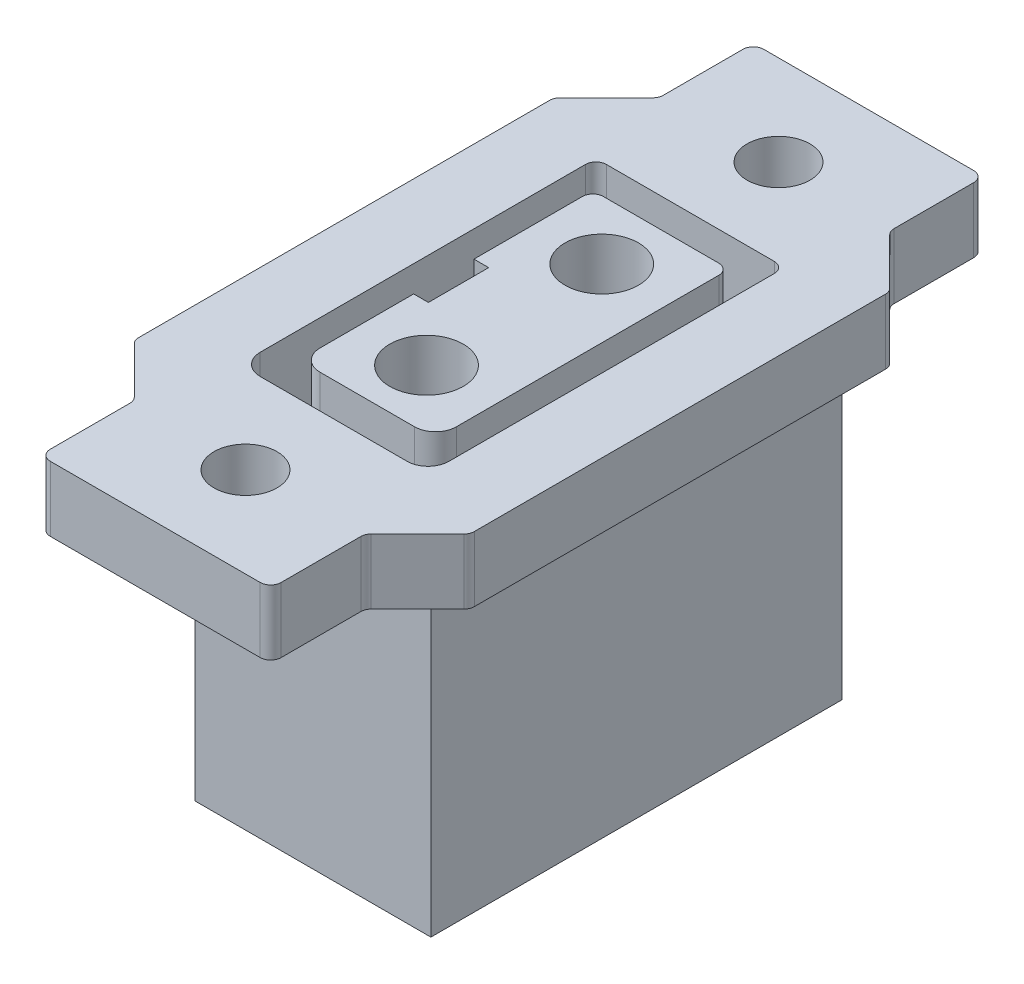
ISO-10303-21;
HEADER;
FILE_DESCRIPTION(('STEP AP214'),'2;1');
FILE_NAME('part.step','',(''),(''),'','','');
FILE_SCHEMA(('AUTOMOTIVE_DESIGN { 1 0 10303 214 1 1 1 1 }'));
ENDSEC;
DATA;
#1=APPLICATION_CONTEXT('core data for automotive mechanical design processes');
#2=APPLICATION_PROTOCOL_DEFINITION('international standard','automotive_design',2000,#1);
#3=PRODUCT_CONTEXT('',#1,'mechanical');
#4=PRODUCT('Part','Part','',(#3));
#5=PRODUCT_RELATED_PRODUCT_CATEGORY('part','',(#4));
#6=PRODUCT_DEFINITION_FORMATION('','',#4);
#7=PRODUCT_DEFINITION_CONTEXT('part definition',#1,'design');
#8=PRODUCT_DEFINITION('design','',#6,#7);
#9=PRODUCT_DEFINITION_SHAPE('','',#8);
#10=(LENGTH_UNIT() NAMED_UNIT(*) SI_UNIT(.MILLI.,.METRE.));
#11=(NAMED_UNIT(*) PLANE_ANGLE_UNIT() SI_UNIT($,.RADIAN.));
#12=(NAMED_UNIT(*) SI_UNIT($,.STERADIAN.) SOLID_ANGLE_UNIT());
#13=UNCERTAINTY_MEASURE_WITH_UNIT(LENGTH_MEASURE(1.E-05),#10,'distance_accuracy_value','');
#14=(GEOMETRIC_REPRESENTATION_CONTEXT(3) GLOBAL_UNCERTAINTY_ASSIGNED_CONTEXT((#13)) GLOBAL_UNIT_ASSIGNED_CONTEXT((#10,
#11,#12)) REPRESENTATION_CONTEXT('',''));
#15=CARTESIAN_POINT('',(0.,0.,0.));
#16=DIRECTION('',(0.,0.,1.));
#17=DIRECTION('',(1.,0.,0.));
#18=AXIS2_PLACEMENT_3D('',#15,#16,#17);
#19=CARTESIAN_POINT('',(0.,-10.,0.));
#20=DIRECTION('',(0.,-1.,0.));
#21=DIRECTION('',(0.,0.,-1.));
#22=AXIS2_PLACEMENT_3D('',#19,#20,#21);
#23=PLANE('',#22);
#24=DIRECTION('',(0.,0.,-1.));
#25=VECTOR('',#24,1.);
#26=CARTESIAN_POINT('',(12.5000000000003,-10.,0.));
#27=LINE('',#26,#25);
#28=CARTESIAN_POINT('',(12.5000000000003,-10.,-9.5));
#29=VERTEX_POINT('',#28);
#30=CARTESIAN_POINT('',(12.5000000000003,-10.,-25.));
#31=VERTEX_POINT('',#30);
#32=EDGE_CURVE('E606',#29,#31,#27,.T.);
#33=ORIENTED_EDGE('',*,*,#32,.T.);
#34=CARTESIAN_POINT('',(12.0000000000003,-10.,-25.));
#35=DIRECTION('',(0.,-1.,0.));
#36=DIRECTION('',(0.,0.,-1.));
#37=AXIS2_PLACEMENT_3D('',#34,#35,#36);
#38=CIRCLE('',#37,0.5);
#39=CARTESIAN_POINT('',(12.0000000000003,-10.,-25.5));
#40=VERTEX_POINT('',#39);
#41=EDGE_CURVE('E960',#31,#40,#38,.F.);
#42=ORIENTED_EDGE('',*,*,#41,.T.);
#43=DIRECTION('',(-1.,0.,0.));
#44=VECTOR('',#43,1.);
#45=CARTESIAN_POINT('',(0.,-10.,-25.5));
#46=LINE('',#45,#44);
#47=CARTESIAN_POINT('',(4.00000000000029,-10.,-25.5));
#48=VERTEX_POINT('',#47);
#49=EDGE_CURVE('E610',#40,#48,#46,.T.);
#50=ORIENTED_EDGE('',*,*,#49,.T.);
#51=CARTESIAN_POINT('',(4.00000000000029,-10.,-25.));
#52=DIRECTION('',(0.,-1.,0.));
#53=DIRECTION('',(0.,0.,-1.));
#54=AXIS2_PLACEMENT_3D('',#51,#52,#53);
#55=CIRCLE('',#54,0.5);
#56=CARTESIAN_POINT('',(3.50000000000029,-10.,-25.));
#57=VERTEX_POINT('',#56);
#58=EDGE_CURVE('E957',#48,#57,#55,.F.);
#59=ORIENTED_EDGE('',*,*,#58,.T.);
#60=DIRECTION('',(0.,0.,1.));
#61=VECTOR('',#60,1.);
#62=CARTESIAN_POINT('',(3.50000000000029,-10.,0.));
#63=LINE('',#62,#61);
#64=CARTESIAN_POINT('',(3.50000000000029,-10.,-9.5));
#65=VERTEX_POINT('',#64);
#66=EDGE_CURVE('E614',#57,#65,#63,.T.);
#67=ORIENTED_EDGE('',*,*,#66,.T.);
#68=CARTESIAN_POINT('',(4.50000000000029,-10.,-9.5));
#69=DIRECTION('',(0.,-1.,0.));
#70=DIRECTION('',(0.,0.,-1.));
#71=AXIS2_PLACEMENT_3D('',#68,#69,#70);
#72=CIRCLE('',#71,1.);
#73=CARTESIAN_POINT('',(4.50000000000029,-10.,-8.5));
#74=VERTEX_POINT('',#73);
#75=EDGE_CURVE('E617',#65,#74,#72,.F.);
#76=ORIENTED_EDGE('',*,*,#75,.T.);
#77=DIRECTION('',(1.,0.,0.));
#78=VECTOR('',#77,1.);
#79=CARTESIAN_POINT('',(0.,-10.,-8.5));
#80=LINE('',#79,#78);
#81=CARTESIAN_POINT('',(11.5000000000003,-10.,-8.5));
#82=VERTEX_POINT('',#81);
#83=EDGE_CURVE('E597',#74,#82,#80,.T.);
#84=ORIENTED_EDGE('',*,*,#83,.T.);
#85=CARTESIAN_POINT('',(11.5000000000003,-10.,-9.5));
#86=DIRECTION('',(0.,-1.,0.));
#87=DIRECTION('',(0.,0.,-1.));
#88=AXIS2_PLACEMENT_3D('',#85,#86,#87);
#89=CIRCLE('',#88,0.999999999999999);
#90=EDGE_CURVE('E601',#82,#29,#89,.F.);
#91=ORIENTED_EDGE('',*,*,#90,.T.);
#92=EDGE_LOOP('',(#33,#42,#50,#59,#67,#76,#84,#91));
#93=FACE_BOUND('',#92,.T.);
#94=DIRECTION('',(0.,0.,-1.));
#95=VECTOR('',#94,1.);
#96=CARTESIAN_POINT('',(4.75000000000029,-10.,0.));
#97=LINE('',#96,#95);
#98=CARTESIAN_POINT('',(4.75000000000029,-10.,-11.1024832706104));
#99=VERTEX_POINT('',#98);
#100=CARTESIAN_POINT('',(4.75000000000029,-10.,-15.563157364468));
#101=VERTEX_POINT('',#100);
#102=EDGE_CURVE('E466',#99,#101,#97,.T.);
#103=ORIENTED_EDGE('',*,*,#102,.T.);
#104=DIRECTION('',(1.,0.,0.));
#105=VECTOR('',#104,1.);
#106=CARTESIAN_POINT('',(0.,-10.,-15.563157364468));
#107=LINE('',#106,#105);
#108=CARTESIAN_POINT('',(5.45242442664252,-10.,-15.563157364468));
#109=VERTEX_POINT('',#108);
#110=EDGE_CURVE('E469',#101,#109,#107,.T.);
#111=ORIENTED_EDGE('',*,*,#110,.T.);
#112=DIRECTION('',(0.,0.,-1.));
#113=VECTOR('',#112,1.);
#114=CARTESIAN_POINT('',(5.45242442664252,-10.,0.));
#115=LINE('',#114,#113);
#116=CARTESIAN_POINT('',(5.45242442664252,-10.,-18.436842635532));
#117=VERTEX_POINT('',#116);
#118=EDGE_CURVE('E494',#109,#117,#115,.T.);
#119=ORIENTED_EDGE('',*,*,#118,.T.);
#120=DIRECTION('',(-1.,0.,0.));
#121=VECTOR('',#120,1.);
#122=CARTESIAN_POINT('',(0.,-10.,-18.436842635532));
#123=LINE('',#122,#121);
#124=CARTESIAN_POINT('',(4.75000000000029,-10.,-18.436842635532));
#125=VERTEX_POINT('',#124);
#126=EDGE_CURVE('E497',#117,#125,#123,.T.);
#127=ORIENTED_EDGE('',*,*,#126,.T.);
#128=DIRECTION('',(0.,0.,-1.));
#129=VECTOR('',#128,1.);
#130=CARTESIAN_POINT('',(4.75000000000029,-10.,0.));
#131=LINE('',#130,#129);
#132=CARTESIAN_POINT('',(4.75000000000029,-10.,-23.6045663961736));
#133=VERTEX_POINT('',#132);
#134=EDGE_CURVE('E503',#125,#133,#131,.T.);
#135=ORIENTED_EDGE('',*,*,#134,.T.);
#136=CARTESIAN_POINT('',(5.25000000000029,-10.,-23.6045663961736));
#137=DIRECTION('',(0.,-1.,0.));
#138=DIRECTION('',(0.,0.,-1.));
#139=AXIS2_PLACEMENT_3D('',#136,#137,#138);
#140=CIRCLE('',#139,0.5);
#141=CARTESIAN_POINT('',(5.25000000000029,-10.,-24.1045663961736));
#142=VERTEX_POINT('',#141);
#143=EDGE_CURVE('E169',#133,#142,#140,.T.);
#144=ORIENTED_EDGE('',*,*,#143,.T.);
#145=DIRECTION('',(1.,0.,0.));
#146=VECTOR('',#145,1.);
#147=CARTESIAN_POINT('',(0.,-10.,-24.1045663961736));
#148=LINE('',#147,#146);
#149=CARTESIAN_POINT('',(10.7500000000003,-10.,-24.1045663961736));
#150=VERTEX_POINT('',#149);
#151=EDGE_CURVE('E507',#142,#150,#148,.T.);
#152=ORIENTED_EDGE('',*,*,#151,.T.);
#153=CARTESIAN_POINT('',(10.7500000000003,-10.,-23.6045663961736));
#154=DIRECTION('',(0.,-1.,0.));
#155=DIRECTION('',(0.,0.,-1.));
#156=AXIS2_PLACEMENT_3D('',#153,#154,#155);
#157=CIRCLE('',#156,0.5);
#158=CARTESIAN_POINT('',(11.2500000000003,-10.,-23.6045663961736));
#159=VERTEX_POINT('',#158);
#160=EDGE_CURVE('E994',#150,#159,#157,.T.);
#161=ORIENTED_EDGE('',*,*,#160,.T.);
#162=DIRECTION('',(0.,0.,1.));
#163=VECTOR('',#162,1.);
#164=CARTESIAN_POINT('',(11.2500000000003,-10.,0.));
#165=LINE('',#164,#163);
#166=CARTESIAN_POINT('',(11.2500000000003,-10.,-11.1024832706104));
#167=VERTEX_POINT('',#166);
#168=EDGE_CURVE('E511',#159,#167,#165,.T.);
#169=ORIENTED_EDGE('',*,*,#168,.T.);
#170=CARTESIAN_POINT('',(10.2500000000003,-10.,-11.1024832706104));
#171=DIRECTION('',(0.,-1.,0.));
#172=DIRECTION('',(0.,0.,-1.));
#173=AXIS2_PLACEMENT_3D('',#170,#171,#172);
#174=CIRCLE('',#173,0.999999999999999);
#175=CARTESIAN_POINT('',(10.2500000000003,-10.,-10.1024832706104));
#176=VERTEX_POINT('',#175);
#177=EDGE_CURVE('E514',#167,#176,#174,.T.);
#178=ORIENTED_EDGE('',*,*,#177,.T.);
#179=DIRECTION('',(1.,0.,0.));
#180=VECTOR('',#179,1.);
#181=CARTESIAN_POINT('',(0.,-10.,-10.1024832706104));
#182=LINE('',#181,#180);
#183=CARTESIAN_POINT('',(5.75000000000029,-10.,-10.1024832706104));
#184=VERTEX_POINT('',#183);
#185=EDGE_CURVE('E1039',#184,#176,#182,.T.);
#186=ORIENTED_EDGE('',*,*,#185,.F.);
#187=CARTESIAN_POINT('',(5.75000000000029,-10.,-11.1024832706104));
#188=DIRECTION('',(0.,-1.,0.));
#189=DIRECTION('',(0.,0.,-1.));
#190=AXIS2_PLACEMENT_3D('',#187,#188,#189);
#191=CIRCLE('',#190,1.);
#192=EDGE_CURVE('E472',#184,#99,#191,.T.);
#193=ORIENTED_EDGE('',*,*,#192,.T.);
#194=EDGE_LOOP('',(#103,#111,#119,#127,#135,#144,#152,#161,#169,#178,#186,#193));
#195=FACE_BOUND('',#194,.T.);
#196=ADVANCED_FACE('F160',(#93,#195),#23,.F.);
#197=CARTESIAN_POINT('',(4.50000000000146,3.1,4.50000000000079));
#198=DIRECTION('',(-0.7071067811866,0.,-0.707106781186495));
#199=DIRECTION('',(-0.707106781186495,0.,0.7071067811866));
#200=AXIS2_PLACEMENT_3D('',#197,#198,#199);
#201=PLANE('',#200);
#202=DIRECTION('',(0.707106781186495,0.,-0.7071067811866));
#203=VECTOR('',#202,1.);
#204=CARTESIAN_POINT('',(4.50000000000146,3.1,4.50000000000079));
#205=LINE('',#204,#203);
#206=CARTESIAN_POINT('',(13.6464466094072,3.1,-4.64644660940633));
#207=VERTEX_POINT('',#206);
#208=CARTESIAN_POINT('',(15.8535533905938,3.1,-6.85355339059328));
#209=VERTEX_POINT('',#208);
#210=EDGE_CURVE('E681',#207,#209,#205,.T.);
#211=ORIENTED_EDGE('',*,*,#210,.F.);
#212=DIRECTION('',(0.,-1.,0.));
#213=VECTOR('',#212,1.);
#214=CARTESIAN_POINT('',(13.6464466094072,3.1,-4.64644660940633));
#215=LINE('',#214,#213);
#216=CARTESIAN_POINT('',(13.6464466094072,0.,-4.64644660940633));
#217=VERTEX_POINT('',#216);
#218=EDGE_CURVE('E883',#207,#217,#215,.T.);
#219=ORIENTED_EDGE('',*,*,#218,.T.);
#220=DIRECTION('',(0.707106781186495,0.,-0.7071067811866));
#221=VECTOR('',#220,1.);
#222=CARTESIAN_POINT('',(4.50000000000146,0.,4.50000000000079));
#223=LINE('',#222,#221);
#224=CARTESIAN_POINT('',(15.8535533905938,0.,-6.85355339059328));
#225=VERTEX_POINT('',#224);
#226=EDGE_CURVE('E737',#217,#225,#223,.T.);
#227=ORIENTED_EDGE('',*,*,#226,.T.);
#228=DIRECTION('',(0.,-1.,0.));
#229=VECTOR('',#228,1.);
#230=CARTESIAN_POINT('',(15.8535533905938,3.1,-6.85355339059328));
#231=LINE('',#230,#229);
#232=EDGE_CURVE('E880',#225,#209,#231,.F.);
#233=ORIENTED_EDGE('',*,*,#232,.T.);
#234=EDGE_LOOP('',(#211,#219,#227,#233));
#235=FACE_BOUND('',#234,.T.);
#236=ADVANCED_FACE('F1070',(#235),#201,.F.);
#237=CARTESIAN_POINT('',(16.0000000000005,3.1,0.));
#238=DIRECTION('',(-1.,0.,0.));
#239=DIRECTION('',(0.,0.,1.));
#240=AXIS2_PLACEMENT_3D('',#237,#238,#239);
#241=PLANE('',#240);
#242=DIRECTION('',(0.,0.,-1.));
#243=VECTOR('',#242,1.);
#244=CARTESIAN_POINT('',(16.0000000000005,3.1,0.));
#245=LINE('',#244,#243);
#246=CARTESIAN_POINT('',(16.0000000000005,3.1,-7.20710678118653));
#247=VERTEX_POINT('',#246);
#248=CARTESIAN_POINT('',(16.0000000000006,3.1,-26.7928932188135));
#249=VERTEX_POINT('',#248);
#250=EDGE_CURVE('E685',#247,#249,#245,.T.);
#251=ORIENTED_EDGE('',*,*,#250,.F.);
#252=DIRECTION('',(0.,-1.,0.));
#253=VECTOR('',#252,1.);
#254=CARTESIAN_POINT('',(16.0000000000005,3.1,-7.20710678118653));
#255=LINE('',#254,#253);
#256=CARTESIAN_POINT('',(16.0000000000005,0.,-7.20710678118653));
#257=VERTEX_POINT('',#256);
#258=EDGE_CURVE('E890',#247,#257,#255,.T.);
#259=ORIENTED_EDGE('',*,*,#258,.T.);
#260=DIRECTION('',(0.,0.,-1.));
#261=VECTOR('',#260,1.);
#262=CARTESIAN_POINT('',(16.0000000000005,0.,0.));
#263=LINE('',#262,#261);
#264=CARTESIAN_POINT('',(16.0000000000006,0.,-26.7928932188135));
#265=VERTEX_POINT('',#264);
#266=EDGE_CURVE('E741',#257,#265,#263,.T.);
#267=ORIENTED_EDGE('',*,*,#266,.T.);
#268=DIRECTION('',(0.,-1.,0.));
#269=VECTOR('',#268,1.);
#270=CARTESIAN_POINT('',(16.0000000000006,3.1,-26.7928932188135));
#271=LINE('',#270,#269);
#272=EDGE_CURVE('E887',#265,#249,#271,.F.);
#273=ORIENTED_EDGE('',*,*,#272,.T.);
#274=EDGE_LOOP('',(#251,#259,#267,#273));
#275=FACE_BOUND('',#274,.T.);
#276=ADVANCED_FACE('F1076',(#275),#241,.F.);
#277=CARTESIAN_POINT('',(21.5000000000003,3.1,-21.5000000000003));
#278=DIRECTION('',(0.707106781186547,0.,-0.707106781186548));
#279=DIRECTION('',(-0.707106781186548,0.,-0.707106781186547));
#280=AXIS2_PLACEMENT_3D('',#277,#278,#279);
#281=PLANE('',#280);
#282=DIRECTION('',(0.707106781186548,0.,0.707106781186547));
#283=VECTOR('',#282,1.);
#284=CARTESIAN_POINT('',(21.5000000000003,3.1,-21.5000000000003));
#285=LINE('',#284,#283);
#286=CARTESIAN_POINT('',(13.6464466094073,3.1,-29.3535533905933));
#287=VERTEX_POINT('',#286);
#288=CARTESIAN_POINT('',(15.8535533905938,3.1,-27.1464466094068));
#289=VERTEX_POINT('',#288);
#290=EDGE_CURVE('E689',#287,#289,#285,.T.);
#291=ORIENTED_EDGE('',*,*,#290,.T.);
#292=DIRECTION('',(0.,-1.,0.));
#293=VECTOR('',#292,1.);
#294=CARTESIAN_POINT('',(15.8535533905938,0.,-27.1464466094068));
#295=LINE('',#294,#293);
#296=CARTESIAN_POINT('',(15.8535533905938,0.,-27.1464466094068));
#297=VERTEX_POINT('',#296);
#298=EDGE_CURVE('E897',#289,#297,#295,.T.);
#299=ORIENTED_EDGE('',*,*,#298,.T.);
#300=DIRECTION('',(0.707106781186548,0.,0.707106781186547));
#301=VECTOR('',#300,1.);
#302=CARTESIAN_POINT('',(21.5000000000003,0.,-21.5000000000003));
#303=LINE('',#302,#301);
#304=CARTESIAN_POINT('',(13.6464466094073,0.,-29.3535533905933));
#305=VERTEX_POINT('',#304);
#306=EDGE_CURVE('E745',#305,#297,#303,.T.);
#307=ORIENTED_EDGE('',*,*,#306,.F.);
#308=DIRECTION('',(0.,-1.,0.));
#309=VECTOR('',#308,1.);
#310=CARTESIAN_POINT('',(13.6464466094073,3.1,-29.3535533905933));
#311=LINE('',#310,#309);
#312=EDGE_CURVE('E894',#305,#287,#311,.F.);
#313=ORIENTED_EDGE('',*,*,#312,.T.);
#314=EDGE_LOOP('',(#291,#299,#307,#313));
#315=FACE_BOUND('',#314,.T.);
#316=ADVANCED_FACE('F1631',(#315),#281,.T.);
#317=CARTESIAN_POINT('',(13.5000000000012,3.1,-2.60208521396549E-13));
#318=DIRECTION('',(1.,0.,0.));
#319=DIRECTION('',(0.,0.,-1.));
#320=AXIS2_PLACEMENT_3D('',#317,#318,#319);
#321=PLANE('',#320);
#322=DIRECTION('',(0.,0.,1.));
#323=VECTOR('',#322,1.);
#324=CARTESIAN_POINT('',(13.5000000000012,3.1,-2.60208521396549E-13));
#325=LINE('',#324,#323);
#326=CARTESIAN_POINT('',(13.5000000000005,3.1,-33.4999999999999));
#327=VERTEX_POINT('',#326);
#328=CARTESIAN_POINT('',(13.5000000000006,3.1,-29.7071067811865));
#329=VERTEX_POINT('',#328);
#330=EDGE_CURVE('E693',#327,#329,#325,.T.);
#331=ORIENTED_EDGE('',*,*,#330,.T.);
#332=DIRECTION('',(0.,-1.,0.));
#333=VECTOR('',#332,1.);
#334=CARTESIAN_POINT('',(13.5000000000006,0.,-29.7071067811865));
#335=LINE('',#334,#333);
#336=CARTESIAN_POINT('',(13.5000000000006,0.,-29.7071067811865));
#337=VERTEX_POINT('',#336);
#338=EDGE_CURVE('E904',#329,#337,#335,.T.);
#339=ORIENTED_EDGE('',*,*,#338,.T.);
#340=DIRECTION('',(0.,0.,1.));
#341=VECTOR('',#340,1.);
#342=CARTESIAN_POINT('',(13.5000000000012,0.,-2.60208521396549E-13));
#343=LINE('',#342,#341);
#344=CARTESIAN_POINT('',(13.5000000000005,0.,-33.4999999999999));
#345=VERTEX_POINT('',#344);
#346=EDGE_CURVE('E749',#345,#337,#343,.T.);
#347=ORIENTED_EDGE('',*,*,#346,.F.);
#348=DIRECTION('',(0.,-1.,0.));
#349=VECTOR('',#348,1.);
#350=CARTESIAN_POINT('',(13.5000000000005,3.1,-33.4999999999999));
#351=LINE('',#350,#349);
#352=EDGE_CURVE('E901',#345,#327,#351,.F.);
#353=ORIENTED_EDGE('',*,*,#352,.T.);
#354=EDGE_LOOP('',(#331,#339,#347,#353));
#355=FACE_BOUND('',#354,.T.);
#356=ADVANCED_FACE('F1622',(#355),#321,.T.);
#357=CARTESIAN_POINT('',(-2.35922392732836E-13,3.1,-33.9999999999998));
#358=DIRECTION('',(0.,0.,-1.));
#359=DIRECTION('',(-1.,0.,0.));
#360=AXIS2_PLACEMENT_3D('',#357,#358,#359);
#361=PLANE('',#360);
#362=DIRECTION('',(1.,0.,0.));
#363=VECTOR('',#362,1.);
#364=CARTESIAN_POINT('',(-2.35922392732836E-13,3.1,-33.9999999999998));
#365=LINE('',#364,#363);
#366=CARTESIAN_POINT('',(3.00000000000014,3.1,-33.9999999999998));
#367=VERTEX_POINT('',#366);
#368=CARTESIAN_POINT('',(13.0000000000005,3.1,-33.9999999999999));
#369=VERTEX_POINT('',#368);
#370=EDGE_CURVE('E697',#367,#369,#365,.T.);
#371=ORIENTED_EDGE('',*,*,#370,.T.);
#372=DIRECTION('',(0.,-1.,0.));
#373=VECTOR('',#372,1.);
#374=CARTESIAN_POINT('',(13.0000000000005,3.1,-33.9999999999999));
#375=LINE('',#374,#373);
#376=CARTESIAN_POINT('',(13.0000000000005,0.,-33.9999999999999));
#377=VERTEX_POINT('',#376);
#378=EDGE_CURVE('E911',#369,#377,#375,.T.);
#379=ORIENTED_EDGE('',*,*,#378,.T.);
#380=DIRECTION('',(1.,0.,0.));
#381=VECTOR('',#380,1.);
#382=CARTESIAN_POINT('',(-2.35922392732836E-13,0.,-33.9999999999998));
#383=LINE('',#382,#381);
#384=CARTESIAN_POINT('',(3.00000000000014,0.,-33.9999999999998));
#385=VERTEX_POINT('',#384);
#386=EDGE_CURVE('E753',#385,#377,#383,.T.);
#387=ORIENTED_EDGE('',*,*,#386,.F.);
#388=DIRECTION('',(0.,-1.,0.));
#389=VECTOR('',#388,1.);
#390=CARTESIAN_POINT('',(3.00000000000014,3.1,-33.9999999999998));
#391=LINE('',#390,#389);
#392=EDGE_CURVE('E908',#385,#367,#391,.F.);
#393=ORIENTED_EDGE('',*,*,#392,.T.);
#394=EDGE_LOOP('',(#371,#379,#387,#393));
#395=FACE_BOUND('',#394,.T.);
#396=ADVANCED_FACE('F1613',(#395),#361,.T.);
#397=CARTESIAN_POINT('',(2.50000000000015,3.1,0.));
#398=DIRECTION('',(-1.,0.,0.));
#399=DIRECTION('',(0.,0.,1.));
#400=AXIS2_PLACEMENT_3D('',#397,#398,#399);
#401=PLANE('',#400);
#402=DIRECTION('',(0.,0.,-1.));
#403=VECTOR('',#402,1.);
#404=CARTESIAN_POINT('',(2.50000000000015,3.1,0.));
#405=LINE('',#404,#403);
#406=CARTESIAN_POINT('',(2.50000000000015,3.1,-29.7071067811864));
#407=VERTEX_POINT('',#406);
#408=CARTESIAN_POINT('',(2.50000000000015,3.1,-33.4999999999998));
#409=VERTEX_POINT('',#408);
#410=EDGE_CURVE('E701',#407,#409,#405,.T.);
#411=ORIENTED_EDGE('',*,*,#410,.T.);
#412=DIRECTION('',(0.,-1.,0.));
#413=VECTOR('',#412,1.);
#414=CARTESIAN_POINT('',(2.50000000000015,3.1,-33.4999999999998));
#415=LINE('',#414,#413);
#416=CARTESIAN_POINT('',(2.50000000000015,0.,-33.4999999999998));
#417=VERTEX_POINT('',#416);
#418=EDGE_CURVE('E918',#409,#417,#415,.T.);
#419=ORIENTED_EDGE('',*,*,#418,.T.);
#420=DIRECTION('',(0.,0.,-1.));
#421=VECTOR('',#420,1.);
#422=CARTESIAN_POINT('',(2.50000000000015,0.,0.));
#423=LINE('',#422,#421);
#424=CARTESIAN_POINT('',(2.50000000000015,0.,-29.7071067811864));
#425=VERTEX_POINT('',#424);
#426=EDGE_CURVE('E757',#425,#417,#423,.T.);
#427=ORIENTED_EDGE('',*,*,#426,.F.);
#428=DIRECTION('',(0.,-1.,0.));
#429=VECTOR('',#428,1.);
#430=CARTESIAN_POINT('',(2.50000000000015,3.1,-29.7071067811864));
#431=LINE('',#430,#429);
#432=EDGE_CURVE('E915',#425,#407,#431,.F.);
#433=ORIENTED_EDGE('',*,*,#432,.T.);
#434=EDGE_LOOP('',(#411,#419,#427,#433));
#435=FACE_BOUND('',#434,.T.);
#436=ADVANCED_FACE('F1604',(#435),#401,.T.);
#437=CARTESIAN_POINT('',(-13.4999999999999,3.1,-13.4999999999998));
#438=DIRECTION('',(0.707106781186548,0.,0.707106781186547));
#439=DIRECTION('',(0.707106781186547,0.,-0.707106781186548));
#440=AXIS2_PLACEMENT_3D('',#437,#438,#439);
#441=PLANE('',#440);
#442=DIRECTION('',(-0.707106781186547,0.,0.707106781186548));
#443=VECTOR('',#442,1.);
#444=CARTESIAN_POINT('',(-13.4999999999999,0.,-13.4999999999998));
#445=LINE('',#444,#443);
#446=CARTESIAN_POINT('',(2.35355339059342,0.,-29.3535533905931));
#447=VERTEX_POINT('',#446);
#448=CARTESIAN_POINT('',(0.146446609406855,0.,-27.1464466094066));
#449=VERTEX_POINT('',#448);
#450=EDGE_CURVE('E761',#447,#449,#445,.T.);
#451=ORIENTED_EDGE('',*,*,#450,.T.);
#452=DIRECTION('',(0.,-1.,0.));
#453=VECTOR('',#452,1.);
#454=CARTESIAN_POINT('',(0.146446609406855,3.1,-27.1464466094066));
#455=LINE('',#454,#453);
#456=CARTESIAN_POINT('',(0.146446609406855,3.1,-27.1464466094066));
#457=VERTEX_POINT('',#456);
#458=EDGE_CURVE('E926',#449,#457,#455,.F.);
#459=ORIENTED_EDGE('',*,*,#458,.T.);
#460=DIRECTION('',(-0.707106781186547,0.,0.707106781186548));
#461=VECTOR('',#460,1.);
#462=CARTESIAN_POINT('',(-13.4999999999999,3.1,-13.4999999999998));
#463=LINE('',#462,#461);
#464=CARTESIAN_POINT('',(2.35355339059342,3.1,-29.3535533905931));
#465=VERTEX_POINT('',#464);
#466=EDGE_CURVE('E705',#465,#457,#463,.T.);
#467=ORIENTED_EDGE('',*,*,#466,.F.);
#468=DIRECTION('',(0.,-1.,0.));
#469=VECTOR('',#468,1.);
#470=CARTESIAN_POINT('',(2.35355339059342,3.1,-29.3535533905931));
#471=LINE('',#470,#469);
#472=EDGE_CURVE('E922',#465,#447,#471,.T.);
#473=ORIENTED_EDGE('',*,*,#472,.T.);
#474=EDGE_LOOP('',(#451,#459,#467,#473));
#475=FACE_BOUND('',#474,.T.);
#476=ADVANCED_FACE('F1595',(#475),#441,.F.);
#477=CARTESIAN_POINT('',(0.,3.1,0.));
#478=DIRECTION('',(1.,0.,0.));
#479=DIRECTION('',(0.,0.,-1.));
#480=AXIS2_PLACEMENT_3D('',#477,#478,#479);
#481=PLANE('',#480);
#482=DIRECTION('',(0.,0.,1.));
#483=VECTOR('',#482,1.);
#484=CARTESIAN_POINT('',(0.,0.,0.));
#485=LINE('',#484,#483);
#486=CARTESIAN_POINT('',(1.29106280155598E-13,0.,-26.7928932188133));
#487=VERTEX_POINT('',#486);
#488=CARTESIAN_POINT('',(0.,0.,-7.20710678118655));
#489=VERTEX_POINT('',#488);
#490=EDGE_CURVE('E765',#487,#489,#485,.T.);
#491=ORIENTED_EDGE('',*,*,#490,.T.);
#492=DIRECTION('',(0.,-1.,0.));
#493=VECTOR('',#492,1.);
#494=CARTESIAN_POINT('',(0.,3.1,-7.20710678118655));
#495=LINE('',#494,#493);
#496=CARTESIAN_POINT('',(0.,3.1,-7.20710678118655));
#497=VERTEX_POINT('',#496);
#498=EDGE_CURVE('E832',#489,#497,#495,.F.);
#499=ORIENTED_EDGE('',*,*,#498,.T.);
#500=DIRECTION('',(0.,0.,1.));
#501=VECTOR('',#500,1.);
#502=CARTESIAN_POINT('',(0.,3.1,0.));
#503=LINE('',#502,#501);
#504=CARTESIAN_POINT('',(1.29106280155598E-13,3.1,-26.7928932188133));
#505=VERTEX_POINT('',#504);
#506=EDGE_CURVE('E709',#505,#497,#503,.T.);
#507=ORIENTED_EDGE('',*,*,#506,.F.);
#508=DIRECTION('',(0.,-1.,0.));
#509=VECTOR('',#508,1.);
#510=CARTESIAN_POINT('',(1.29106280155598E-13,3.1,-26.7928932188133));
#511=LINE('',#510,#509);
#512=EDGE_CURVE('E828',#505,#487,#511,.T.);
#513=ORIENTED_EDGE('',*,*,#512,.T.);
#514=EDGE_LOOP('',(#491,#499,#507,#513));
#515=FACE_BOUND('',#514,.T.);
#516=ADVANCED_FACE('F1586',(#515),#481,.F.);
#517=CARTESIAN_POINT('',(3.50000000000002,3.1,-3.50000000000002));
#518=DIRECTION('',(0.707106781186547,0.,-0.707106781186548));
#519=DIRECTION('',(-0.707106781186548,0.,-0.707106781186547));
#520=AXIS2_PLACEMENT_3D('',#517,#518,#519);
#521=PLANE('',#520);
#522=DIRECTION('',(0.707106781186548,0.,0.707106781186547));
#523=VECTOR('',#522,1.);
#524=CARTESIAN_POINT('',(3.50000000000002,3.1,-3.50000000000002));
#525=LINE('',#524,#523);
#526=CARTESIAN_POINT('',(0.14644660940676,3.1,-6.85355339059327));
#527=VERTEX_POINT('',#526);
#528=CARTESIAN_POINT('',(2.35355339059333,3.1,-4.64644660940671));
#529=VERTEX_POINT('',#528);
#530=EDGE_CURVE('E713',#527,#529,#525,.T.);
#531=ORIENTED_EDGE('',*,*,#530,.F.);
#532=DIRECTION('',(0.,-1.,0.));
#533=VECTOR('',#532,1.);
#534=CARTESIAN_POINT('',(0.146446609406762,3.1,-6.85355339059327));
#535=LINE('',#534,#533);
#536=CARTESIAN_POINT('',(0.14644660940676,0.,-6.85355339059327));
#537=VERTEX_POINT('',#536);
#538=EDGE_CURVE('E800',#527,#537,#535,.T.);
#539=ORIENTED_EDGE('',*,*,#538,.T.);
#540=DIRECTION('',(0.707106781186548,0.,0.707106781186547));
#541=VECTOR('',#540,1.);
#542=CARTESIAN_POINT('',(3.50000000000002,0.,-3.50000000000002));
#543=LINE('',#542,#541);
#544=CARTESIAN_POINT('',(2.35355339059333,0.,-4.64644660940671));
#545=VERTEX_POINT('',#544);
#546=EDGE_CURVE('E769',#537,#545,#543,.T.);
#547=ORIENTED_EDGE('',*,*,#546,.T.);
#548=DIRECTION('',(0.,-1.,0.));
#549=VECTOR('',#548,1.);
#550=CARTESIAN_POINT('',(2.35355339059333,3.1,-4.64644660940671));
#551=LINE('',#550,#549);
#552=EDGE_CURVE('E797',#545,#529,#551,.F.);
#553=ORIENTED_EDGE('',*,*,#552,.T.);
#554=EDGE_LOOP('',(#531,#539,#547,#553));
#555=FACE_BOUND('',#554,.T.);
#556=ADVANCED_FACE('F1577',(#555),#521,.F.);
#557=CARTESIAN_POINT('',(2.50000000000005,3.1,0.));
#558=DIRECTION('',(-1.,0.,0.));
#559=DIRECTION('',(0.,0.,1.));
#560=AXIS2_PLACEMENT_3D('',#557,#558,#559);
#561=PLANE('',#560);
#562=DIRECTION('',(0.,0.,-1.));
#563=VECTOR('',#562,1.);
#564=CARTESIAN_POINT('',(2.50000000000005,3.1,0.));
#565=LINE('',#564,#563);
#566=CARTESIAN_POINT('',(2.50000000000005,3.1,-0.499999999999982));
#567=VERTEX_POINT('',#566);
#568=CARTESIAN_POINT('',(2.50000000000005,3.1,-4.29289321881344));
#569=VERTEX_POINT('',#568);
#570=EDGE_CURVE('E717',#567,#569,#565,.T.);
#571=ORIENTED_EDGE('',*,*,#570,.T.);
#572=DIRECTION('',(0.,-1.,0.));
#573=VECTOR('',#572,1.);
#574=CARTESIAN_POINT('',(2.50000000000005,3.1,-4.29289321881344));
#575=LINE('',#574,#573);
#576=CARTESIAN_POINT('',(2.50000000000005,0.,-4.29289321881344));
#577=VERTEX_POINT('',#576);
#578=EDGE_CURVE('E862',#569,#577,#575,.T.);
#579=ORIENTED_EDGE('',*,*,#578,.T.);
#580=DIRECTION('',(0.,0.,-1.));
#581=VECTOR('',#580,1.);
#582=CARTESIAN_POINT('',(2.50000000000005,0.,0.));
#583=LINE('',#582,#581);
#584=CARTESIAN_POINT('',(2.50000000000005,0.,-0.499999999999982));
#585=VERTEX_POINT('',#584);
#586=EDGE_CURVE('E773',#585,#577,#583,.T.);
#587=ORIENTED_EDGE('',*,*,#586,.F.);
#588=DIRECTION('',(0.,-1.,0.));
#589=VECTOR('',#588,1.);
#590=CARTESIAN_POINT('',(2.50000000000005,3.1,-0.499999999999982));
#591=LINE('',#590,#589);
#592=EDGE_CURVE('E859',#585,#567,#591,.F.);
#593=ORIENTED_EDGE('',*,*,#592,.T.);
#594=EDGE_LOOP('',(#571,#579,#587,#593));
#595=FACE_BOUND('',#594,.T.);
#596=ADVANCED_FACE('F1119',(#595),#561,.T.);
#597=CARTESIAN_POINT('',(0.,3.1,0.));
#598=DIRECTION('',(0.,0.,1.));
#599=DIRECTION('',(1.,0.,0.));
#600=AXIS2_PLACEMENT_3D('',#597,#598,#599);
#601=PLANE('',#600);
#602=DIRECTION('',(-1.,0.,0.));
#603=VECTOR('',#602,1.);
#604=CARTESIAN_POINT('',(0.,3.1,0.));
#605=LINE('',#604,#603);
#606=CARTESIAN_POINT('',(13.0000000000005,3.1,1.36514111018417E-13));
#607=VERTEX_POINT('',#606);
#608=CARTESIAN_POINT('',(3.00000000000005,3.1,0.));
#609=VERTEX_POINT('',#608);
#610=EDGE_CURVE('E721',#607,#609,#605,.T.);
#611=ORIENTED_EDGE('',*,*,#610,.T.);
#612=DIRECTION('',(0.,-1.,0.));
#613=VECTOR('',#612,1.);
#614=CARTESIAN_POINT('',(3.00000000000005,3.1,0.));
#615=LINE('',#614,#613);
#616=CARTESIAN_POINT('',(3.00000000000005,0.,0.));
#617=VERTEX_POINT('',#616);
#618=EDGE_CURVE('E869',#609,#617,#615,.T.);
#619=ORIENTED_EDGE('',*,*,#618,.T.);
#620=DIRECTION('',(-1.,0.,0.));
#621=VECTOR('',#620,1.);
#622=CARTESIAN_POINT('',(0.,0.,0.));
#623=LINE('',#622,#621);
#624=CARTESIAN_POINT('',(13.0000000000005,0.,1.36514111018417E-13));
#625=VERTEX_POINT('',#624);
#626=EDGE_CURVE('E777',#625,#617,#623,.T.);
#627=ORIENTED_EDGE('',*,*,#626,.F.);
#628=DIRECTION('',(0.,-1.,0.));
#629=VECTOR('',#628,1.);
#630=CARTESIAN_POINT('',(13.0000000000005,3.1,1.36514111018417E-13));
#631=LINE('',#630,#629);
#632=EDGE_CURVE('E866',#625,#607,#631,.F.);
#633=ORIENTED_EDGE('',*,*,#632,.T.);
#634=EDGE_LOOP('',(#611,#619,#627,#633));
#635=FACE_BOUND('',#634,.T.);
#636=ADVANCED_FACE('F1111',(#635),#601,.T.);
#637=CARTESIAN_POINT('',(11.5000000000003,3.1,-9.5));
#638=DIRECTION('',(0.,-1.,0.));
#639=DIRECTION('',(0.,0.,-1.));
#640=AXIS2_PLACEMENT_3D('',#637,#638,#639);
#641=CYLINDRICAL_SURFACE('',#640,0.999999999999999);
#642=DIRECTION('',(0.,-1.,0.));
#643=VECTOR('',#642,1.);
#644=CARTESIAN_POINT('',(12.5000000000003,3.1,-9.5));
#645=LINE('',#644,#643);
#646=CARTESIAN_POINT('',(12.5000000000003,3.1,-9.5));
#647=VERTEX_POINT('',#646);
#648=EDGE_CURVE('E729',#647,#29,#645,.T.);
#649=ORIENTED_EDGE('',*,*,#648,.T.);
#650=ORIENTED_EDGE('',*,*,#90,.F.);
#651=DIRECTION('',(0.,-1.,0.));
#652=VECTOR('',#651,1.);
#653=CARTESIAN_POINT('',(11.5000000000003,3.1,-8.5));
#654=LINE('',#653,#652);
#655=CARTESIAN_POINT('',(11.5000000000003,3.1,-8.5));
#656=VERTEX_POINT('',#655);
#657=EDGE_CURVE('E794',#656,#82,#654,.T.);
#658=ORIENTED_EDGE('',*,*,#657,.F.);
#659=CARTESIAN_POINT('',(11.5000000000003,3.1,-9.5));
#660=DIRECTION('',(0.,1.,0.));
#661=DIRECTION('',(0.,0.,1.));
#662=AXIS2_PLACEMENT_3D('',#659,#660,#661);
#663=CIRCLE('',#662,0.999999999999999);
#664=EDGE_CURVE('E650',#656,#647,#663,.T.);
#665=ORIENTED_EDGE('',*,*,#664,.T.);
#666=EDGE_LOOP('',(#649,#650,#658,#665));
#667=FACE_BOUND('',#666,.T.);
#668=ADVANCED_FACE('F1109',(#667),#641,.F.);
#669=CARTESIAN_POINT('',(0.,3.1,-8.5));
#670=DIRECTION('',(0.,0.,-1.));
#671=DIRECTION('',(-1.,0.,0.));
#672=AXIS2_PLACEMENT_3D('',#669,#670,#671);
#673=PLANE('',#672);
#674=ORIENTED_EDGE('',*,*,#657,.T.);
#675=ORIENTED_EDGE('',*,*,#83,.F.);
#676=DIRECTION('',(0.,-1.,0.));
#677=VECTOR('',#676,1.);
#678=CARTESIAN_POINT('',(4.50000000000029,3.1,-8.5));
#679=LINE('',#678,#677);
#680=CARTESIAN_POINT('',(4.50000000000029,3.1,-8.5));
#681=VERTEX_POINT('',#680);
#682=EDGE_CURVE('E790',#681,#74,#679,.T.);
#683=ORIENTED_EDGE('',*,*,#682,.F.);
#684=DIRECTION('',(1.,0.,0.));
#685=VECTOR('',#684,1.);
#686=CARTESIAN_POINT('',(0.,3.1,-8.5));
#687=LINE('',#686,#685);
#688=EDGE_CURVE('E654',#681,#656,#687,.T.);
#689=ORIENTED_EDGE('',*,*,#688,.T.);
#690=EDGE_LOOP('',(#674,#675,#683,#689));
#691=FACE_BOUND('',#690,.T.);
#692=ADVANCED_FACE('F1106',(#691),#673,.T.);
#693=CARTESIAN_POINT('',(4.50000000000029,3.1,-9.5));
#694=DIRECTION('',(0.,-1.,0.));
#695=DIRECTION('',(0.,0.,-1.));
#696=AXIS2_PLACEMENT_3D('',#693,#694,#695);
#697=CYLINDRICAL_SURFACE('',#696,1.);
#698=ORIENTED_EDGE('',*,*,#682,.T.);
#699=ORIENTED_EDGE('',*,*,#75,.F.);
#700=DIRECTION('',(0.,-1.,0.));
#701=VECTOR('',#700,1.);
#702=CARTESIAN_POINT('',(3.50000000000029,3.1,-9.5));
#703=LINE('',#702,#701);
#704=CARTESIAN_POINT('',(3.50000000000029,3.1,-9.5));
#705=VERTEX_POINT('',#704);
#706=EDGE_CURVE('E786',#705,#65,#703,.T.);
#707=ORIENTED_EDGE('',*,*,#706,.F.);
#708=CARTESIAN_POINT('',(4.50000000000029,3.1,-9.5));
#709=DIRECTION('',(0.,1.,0.));
#710=DIRECTION('',(0.,0.,1.));
#711=AXIS2_PLACEMENT_3D('',#708,#709,#710);
#712=CIRCLE('',#711,1.);
#713=EDGE_CURVE('E659',#705,#681,#712,.T.);
#714=ORIENTED_EDGE('',*,*,#713,.T.);
#715=EDGE_LOOP('',(#698,#699,#707,#714));
#716=FACE_BOUND('',#715,.T.);
#717=ADVANCED_FACE('F1104',(#716),#697,.F.);
#718=CARTESIAN_POINT('',(3.50000000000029,3.1,0.));
#719=DIRECTION('',(1.,0.,0.));
#720=DIRECTION('',(0.,0.,-1.));
#721=AXIS2_PLACEMENT_3D('',#718,#719,#720);
#722=PLANE('',#721);
#723=ORIENTED_EDGE('',*,*,#66,.F.);
#724=DIRECTION('',(0.,-1.,0.));
#725=VECTOR('',#724,1.);
#726=CARTESIAN_POINT('',(3.50000000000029,3.1,-25.));
#727=LINE('',#726,#725);
#728=CARTESIAN_POINT('',(3.50000000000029,3.1,-25.));
#729=VERTEX_POINT('',#728);
#730=EDGE_CURVE('E176',#57,#729,#727,.F.);
#731=ORIENTED_EDGE('',*,*,#730,.T.);
#732=DIRECTION('',(0.,0.,1.));
#733=VECTOR('',#732,1.);
#734=CARTESIAN_POINT('',(3.50000000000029,3.1,0.));
#735=LINE('',#734,#733);
#736=EDGE_CURVE('E663',#729,#705,#735,.T.);
#737=ORIENTED_EDGE('',*,*,#736,.T.);
#738=ORIENTED_EDGE('',*,*,#706,.T.);
#739=EDGE_LOOP('',(#723,#731,#737,#738));
#740=FACE_BOUND('',#739,.T.);
#741=ADVANCED_FACE('F1100',(#740),#722,.T.);
#742=CARTESIAN_POINT('',(0.,3.1,-25.5));
#743=DIRECTION('',(0.,0.,-1.));
#744=DIRECTION('',(-1.,0.,0.));
#745=AXIS2_PLACEMENT_3D('',#742,#743,#744);
#746=PLANE('',#745);
#747=ORIENTED_EDGE('',*,*,#49,.F.);
#748=DIRECTION('',(0.,-1.,0.));
#749=VECTOR('',#748,1.);
#750=CARTESIAN_POINT('',(12.0000000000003,3.1,-25.5));
#751=LINE('',#750,#749);
#752=CARTESIAN_POINT('',(12.0000000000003,3.1,-25.5));
#753=VERTEX_POINT('',#752);
#754=EDGE_CURVE('E967',#40,#753,#751,.F.);
#755=ORIENTED_EDGE('',*,*,#754,.T.);
#756=DIRECTION('',(1.,0.,0.));
#757=VECTOR('',#756,1.);
#758=CARTESIAN_POINT('',(0.,3.1,-25.5));
#759=LINE('',#758,#757);
#760=CARTESIAN_POINT('',(4.00000000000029,3.1,-25.5));
#761=VERTEX_POINT('',#760);
#762=EDGE_CURVE('E666',#761,#753,#759,.T.);
#763=ORIENTED_EDGE('',*,*,#762,.F.);
#764=DIRECTION('',(0.,-1.,0.));
#765=VECTOR('',#764,1.);
#766=CARTESIAN_POINT('',(4.00000000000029,3.1,-25.5));
#767=LINE('',#766,#765);
#768=EDGE_CURVE('E963',#761,#48,#767,.T.);
#769=ORIENTED_EDGE('',*,*,#768,.T.);
#770=EDGE_LOOP('',(#747,#755,#763,#769));
#771=FACE_BOUND('',#770,.T.);
#772=ADVANCED_FACE('F1091',(#771),#746,.F.);
#773=CARTESIAN_POINT('',(8.00000000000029,3.1,-29.7));
#774=DIRECTION('',(0.,-1.,0.));
#775=DIRECTION('',(0.,0.,-1.));
#776=AXIS2_PLACEMENT_3D('',#773,#774,#775);
#777=CYLINDRICAL_SURFACE('',#776,1.5);
#778=CARTESIAN_POINT('',(8.00000000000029,3.1,-29.7));
#779=DIRECTION('',(0.,1.,0.));
#780=DIRECTION('',(0.,0.,1.));
#781=AXIS2_PLACEMENT_3D('',#778,#779,#780);
#782=CIRCLE('',#781,1.5);
#783=CARTESIAN_POINT('',(8.00000000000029,3.1,-31.2));
#784=VERTEX_POINT('',#783);
#785=EDGE_CURVE('E677',#784,#784,#782,.T.);
#786=CARTESIAN_POINT('',(8.00000000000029,0.,-29.7));
#787=DIRECTION('',(0.,1.,0.));
#788=DIRECTION('',(0.,0.,1.));
#789=AXIS2_PLACEMENT_3D('',#786,#787,#788);
#790=CIRCLE('',#789,1.5);
#791=CARTESIAN_POINT('',(8.00000000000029,0.,-31.2));
#792=VERTEX_POINT('',#791);
#793=EDGE_CURVE('E733',#792,#792,#790,.T.);
#794=CARTESIAN_POINT('',(8.00000000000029,3.1,-31.2));
#795=CARTESIAN_POINT('',(8.00000000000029,3.06770833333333,-31.2));
#796=CARTESIAN_POINT('',(8.00000000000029,3.03541666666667,-31.2));
#797=CARTESIAN_POINT('',(8.00000000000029,2.97083333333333,-31.2));
#798=CARTESIAN_POINT('',(8.00000000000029,2.93854166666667,-31.2));
#799=CARTESIAN_POINT('',(8.00000000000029,2.87395833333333,-31.2));
#800=CARTESIAN_POINT('',(8.00000000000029,2.84166666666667,-31.2));
#801=CARTESIAN_POINT('',(8.00000000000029,2.77708333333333,-31.2));
#802=CARTESIAN_POINT('',(8.00000000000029,2.74479166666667,-31.2));
#803=CARTESIAN_POINT('',(8.00000000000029,2.68020833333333,-31.2));
#804=CARTESIAN_POINT('',(8.00000000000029,2.64791666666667,-31.2));
#805=CARTESIAN_POINT('',(8.00000000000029,2.58333333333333,-31.2));
#806=CARTESIAN_POINT('',(8.00000000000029,2.55104166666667,-31.2));
#807=CARTESIAN_POINT('',(8.00000000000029,2.48645833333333,-31.2));
#808=CARTESIAN_POINT('',(8.00000000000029,2.45416666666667,-31.2));
#809=CARTESIAN_POINT('',(8.00000000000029,2.38958333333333,-31.2));
#810=CARTESIAN_POINT('',(8.00000000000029,2.35729166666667,-31.2));
#811=CARTESIAN_POINT('',(8.00000000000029,2.29270833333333,-31.2));
#812=CARTESIAN_POINT('',(8.00000000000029,2.26041666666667,-31.2));
#813=CARTESIAN_POINT('',(8.00000000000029,2.19583333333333,-31.2));
#814=CARTESIAN_POINT('',(8.00000000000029,2.16354166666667,-31.2));
#815=CARTESIAN_POINT('',(8.00000000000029,2.09895833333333,-31.2));
#816=CARTESIAN_POINT('',(8.00000000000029,2.06666666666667,-31.2));
#817=CARTESIAN_POINT('',(8.00000000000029,2.00208333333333,-31.2));
#818=CARTESIAN_POINT('',(8.00000000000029,1.96979166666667,-31.2));
#819=CARTESIAN_POINT('',(8.00000000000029,1.90520833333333,-31.2));
#820=CARTESIAN_POINT('',(8.00000000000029,1.87291666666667,-31.2));
#821=CARTESIAN_POINT('',(8.00000000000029,1.80833333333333,-31.2));
#822=CARTESIAN_POINT('',(8.00000000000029,1.77604166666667,-31.2));
#823=CARTESIAN_POINT('',(8.00000000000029,1.71145833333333,-31.2));
#824=CARTESIAN_POINT('',(8.00000000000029,1.67916666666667,-31.2));
#825=CARTESIAN_POINT('',(8.00000000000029,1.61458333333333,-31.2));
#826=CARTESIAN_POINT('',(8.00000000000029,1.58229166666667,-31.2));
#827=CARTESIAN_POINT('',(8.00000000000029,1.51770833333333,-31.2));
#828=CARTESIAN_POINT('',(8.00000000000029,1.48541666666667,-31.2));
#829=CARTESIAN_POINT('',(8.00000000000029,1.42083333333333,-31.2));
#830=CARTESIAN_POINT('',(8.00000000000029,1.38854166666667,-31.2));
#831=CARTESIAN_POINT('',(8.00000000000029,1.32395833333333,-31.2));
#832=CARTESIAN_POINT('',(8.00000000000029,1.29166666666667,-31.2));
#833=CARTESIAN_POINT('',(8.00000000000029,1.22708333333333,-31.2));
#834=CARTESIAN_POINT('',(8.00000000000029,1.19479166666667,-31.2));
#835=CARTESIAN_POINT('',(8.00000000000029,1.13020833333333,-31.2));
#836=CARTESIAN_POINT('',(8.00000000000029,1.09791666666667,-31.2));
#837=CARTESIAN_POINT('',(8.00000000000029,1.03333333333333,-31.2));
#838=CARTESIAN_POINT('',(8.00000000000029,1.00104166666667,-31.2));
#839=CARTESIAN_POINT('',(8.00000000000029,0.936458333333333,-31.2));
#840=CARTESIAN_POINT('',(8.00000000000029,0.904166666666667,-31.2));
#841=CARTESIAN_POINT('',(8.00000000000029,0.839583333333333,-31.2));
#842=CARTESIAN_POINT('',(8.00000000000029,0.807291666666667,-31.2));
#843=CARTESIAN_POINT('',(8.00000000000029,0.742708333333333,-31.2));
#844=CARTESIAN_POINT('',(8.00000000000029,0.710416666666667,-31.2));
#845=CARTESIAN_POINT('',(8.00000000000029,0.645833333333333,-31.2));
#846=CARTESIAN_POINT('',(8.00000000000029,0.613541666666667,-31.2));
#847=CARTESIAN_POINT('',(8.00000000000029,0.548958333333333,-31.2));
#848=CARTESIAN_POINT('',(8.00000000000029,0.516666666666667,-31.2));
#849=CARTESIAN_POINT('',(8.00000000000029,0.452083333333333,-31.2));
#850=CARTESIAN_POINT('',(8.00000000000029,0.419791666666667,-31.2));
#851=CARTESIAN_POINT('',(8.00000000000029,0.355208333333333,-31.2));
#852=CARTESIAN_POINT('',(8.00000000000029,0.322916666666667,-31.2));
#853=CARTESIAN_POINT('',(8.00000000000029,0.258333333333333,-31.2));
#854=CARTESIAN_POINT('',(8.00000000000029,0.226041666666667,-31.2));
#855=CARTESIAN_POINT('',(8.00000000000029,0.161458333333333,-31.2));
#856=CARTESIAN_POINT('',(8.00000000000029,0.129166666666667,-31.2));
#857=CARTESIAN_POINT('',(8.00000000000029,0.0645833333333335,-31.2));
#858=CARTESIAN_POINT('',(8.00000000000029,0.0322916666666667,-31.2));
#859=CARTESIAN_POINT('',(8.00000000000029,0.,-31.2));
#860=B_SPLINE_CURVE_WITH_KNOTS('',3,(#794,#795,#796,#797,#798,#799,#800,#801,#802,#803,#804,
#805,#806,#807,#808,#809,#810,#811,#812,#813,#814,#815,#816,#817,#818,#819,#820,#821,#822,#823,
#824,#825,#826,#827,#828,#829,#830,#831,#832,#833,#834,#835,#836,#837,#838,#839,#840,#841,#842,
#843,#844,#845,#846,#847,#848,#849,#850,#851,#852,#853,#854,#855,#856,#857,#858,#859),
.UNSPECIFIED.,.F.,.F.,(4,2,2,2,2,2,2,2,2,2,2,2,2,2,2,2,2,2,2,2,2,2,2,2,2,2,2,2,2,2,2,2,4),(0.,
0.0968749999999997,0.19375,0.290625,0.3875,0.484375,0.58125,0.678125,0.775,0.871874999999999,
0.96875,1.065625,1.1625,1.259375,1.35625,1.453125,1.55,1.646875,1.74375,1.840625,1.9375,
2.034375,2.13125,2.228125,2.325,2.421875,2.51875,2.615625,2.7125,2.809375,2.90625,3.003125,3.1),.UNSPECIFIED.);
#861=EDGE_CURVE('BSEAM1521',#784,#792,#860,.T.);
#862=ORIENTED_EDGE('',*,*,#785,.T.);
#863=ORIENTED_EDGE('',*,*,#793,.F.);
#864=ORIENTED_EDGE('',*,*,#861,.T.);
#865=ORIENTED_EDGE('',*,*,#861,.F.);
#866=EDGE_LOOP('',(#862,#864,#863,#865));
#867=FACE_BOUND('',#866,.T.);
#868=ADVANCED_FACE('F1521',(#867),#777,.F.);
#869=CARTESIAN_POINT('',(8.00000000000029,3.1,-4.29999999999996));
#870=DIRECTION('',(0.,-1.,0.));
#871=DIRECTION('',(0.,0.,-1.));
#872=AXIS2_PLACEMENT_3D('',#869,#870,#871);
#873=CYLINDRICAL_SURFACE('',#872,1.5);
#874=CARTESIAN_POINT('',(8.00000000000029,3.1,-4.29999999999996));
#875=DIRECTION('',(0.,1.,0.));
#876=DIRECTION('',(0.,0.,1.));
#877=AXIS2_PLACEMENT_3D('',#874,#875,#876);
#878=CIRCLE('',#877,1.5);
#879=CARTESIAN_POINT('',(8.00000000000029,3.1,-5.79999999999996));
#880=VERTEX_POINT('',#879);
#881=EDGE_CURVE('E673',#880,#880,#878,.T.);
#882=CARTESIAN_POINT('',(8.00000000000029,0.,-4.29999999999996));
#883=DIRECTION('',(0.,1.,0.));
#884=DIRECTION('',(0.,0.,1.));
#885=AXIS2_PLACEMENT_3D('',#882,#883,#884);
#886=CIRCLE('',#885,1.5);
#887=CARTESIAN_POINT('',(8.00000000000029,0.,-5.79999999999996));
#888=VERTEX_POINT('',#887);
#889=EDGE_CURVE('E649',#888,#888,#886,.T.);
#890=CARTESIAN_POINT('',(8.00000000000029,3.1,-5.79999999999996));
#891=CARTESIAN_POINT('',(8.00000000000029,3.06770833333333,-5.79999999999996));
#892=CARTESIAN_POINT('',(8.00000000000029,3.03541666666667,-5.79999999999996));
#893=CARTESIAN_POINT('',(8.00000000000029,2.97083333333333,-5.79999999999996));
#894=CARTESIAN_POINT('',(8.00000000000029,2.93854166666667,-5.79999999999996));
#895=CARTESIAN_POINT('',(8.00000000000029,2.87395833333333,-5.79999999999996));
#896=CARTESIAN_POINT('',(8.00000000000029,2.84166666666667,-5.79999999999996));
#897=CARTESIAN_POINT('',(8.00000000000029,2.77708333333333,-5.79999999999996));
#898=CARTESIAN_POINT('',(8.00000000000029,2.74479166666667,-5.79999999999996));
#899=CARTESIAN_POINT('',(8.00000000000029,2.68020833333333,-5.79999999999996));
#900=CARTESIAN_POINT('',(8.00000000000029,2.64791666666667,-5.79999999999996));
#901=CARTESIAN_POINT('',(8.00000000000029,2.58333333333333,-5.79999999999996));
#902=CARTESIAN_POINT('',(8.00000000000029,2.55104166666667,-5.79999999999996));
#903=CARTESIAN_POINT('',(8.00000000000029,2.48645833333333,-5.79999999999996));
#904=CARTESIAN_POINT('',(8.00000000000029,2.45416666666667,-5.79999999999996));
#905=CARTESIAN_POINT('',(8.00000000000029,2.38958333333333,-5.79999999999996));
#906=CARTESIAN_POINT('',(8.00000000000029,2.35729166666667,-5.79999999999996));
#907=CARTESIAN_POINT('',(8.00000000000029,2.29270833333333,-5.79999999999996));
#908=CARTESIAN_POINT('',(8.00000000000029,2.26041666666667,-5.79999999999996));
#909=CARTESIAN_POINT('',(8.00000000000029,2.19583333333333,-5.79999999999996));
#910=CARTESIAN_POINT('',(8.00000000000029,2.16354166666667,-5.79999999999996));
#911=CARTESIAN_POINT('',(8.00000000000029,2.09895833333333,-5.79999999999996));
#912=CARTESIAN_POINT('',(8.00000000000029,2.06666666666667,-5.79999999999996));
#913=CARTESIAN_POINT('',(8.00000000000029,2.00208333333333,-5.79999999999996));
#914=CARTESIAN_POINT('',(8.00000000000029,1.96979166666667,-5.79999999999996));
#915=CARTESIAN_POINT('',(8.00000000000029,1.90520833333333,-5.79999999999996));
#916=CARTESIAN_POINT('',(8.00000000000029,1.87291666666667,-5.79999999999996));
#917=CARTESIAN_POINT('',(8.00000000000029,1.80833333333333,-5.79999999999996));
#918=CARTESIAN_POINT('',(8.00000000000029,1.77604166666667,-5.79999999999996));
#919=CARTESIAN_POINT('',(8.00000000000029,1.71145833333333,-5.79999999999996));
#920=CARTESIAN_POINT('',(8.00000000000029,1.67916666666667,-5.79999999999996));
#921=CARTESIAN_POINT('',(8.00000000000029,1.61458333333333,-5.79999999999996));
#922=CARTESIAN_POINT('',(8.00000000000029,1.58229166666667,-5.79999999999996));
#923=CARTESIAN_POINT('',(8.00000000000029,1.51770833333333,-5.79999999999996));
#924=CARTESIAN_POINT('',(8.00000000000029,1.48541666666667,-5.79999999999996));
#925=CARTESIAN_POINT('',(8.00000000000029,1.42083333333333,-5.79999999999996));
#926=CARTESIAN_POINT('',(8.00000000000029,1.38854166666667,-5.79999999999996));
#927=CARTESIAN_POINT('',(8.00000000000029,1.32395833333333,-5.79999999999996));
#928=CARTESIAN_POINT('',(8.00000000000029,1.29166666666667,-5.79999999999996));
#929=CARTESIAN_POINT('',(8.00000000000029,1.22708333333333,-5.79999999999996));
#930=CARTESIAN_POINT('',(8.00000000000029,1.19479166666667,-5.79999999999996));
#931=CARTESIAN_POINT('',(8.00000000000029,1.13020833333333,-5.79999999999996));
#932=CARTESIAN_POINT('',(8.00000000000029,1.09791666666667,-5.79999999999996));
#933=CARTESIAN_POINT('',(8.00000000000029,1.03333333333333,-5.79999999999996));
#934=CARTESIAN_POINT('',(8.00000000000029,1.00104166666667,-5.79999999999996));
#935=CARTESIAN_POINT('',(8.00000000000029,0.936458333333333,-5.79999999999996));
#936=CARTESIAN_POINT('',(8.00000000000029,0.904166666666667,-5.79999999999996));
#937=CARTESIAN_POINT('',(8.00000000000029,0.839583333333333,-5.79999999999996));
#938=CARTESIAN_POINT('',(8.00000000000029,0.807291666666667,-5.79999999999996));
#939=CARTESIAN_POINT('',(8.00000000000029,0.742708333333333,-5.79999999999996));
#940=CARTESIAN_POINT('',(8.00000000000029,0.710416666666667,-5.79999999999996));
#941=CARTESIAN_POINT('',(8.00000000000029,0.645833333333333,-5.79999999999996));
#942=CARTESIAN_POINT('',(8.00000000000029,0.613541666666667,-5.79999999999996));
#943=CARTESIAN_POINT('',(8.00000000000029,0.548958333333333,-5.79999999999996));
#944=CARTESIAN_POINT('',(8.00000000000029,0.516666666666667,-5.79999999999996));
#945=CARTESIAN_POINT('',(8.00000000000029,0.452083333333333,-5.79999999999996));
#946=CARTESIAN_POINT('',(8.00000000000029,0.419791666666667,-5.79999999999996));
#947=CARTESIAN_POINT('',(8.00000000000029,0.355208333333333,-5.79999999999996));
#948=CARTESIAN_POINT('',(8.00000000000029,0.322916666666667,-5.79999999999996));
#949=CARTESIAN_POINT('',(8.00000000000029,0.258333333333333,-5.79999999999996));
#950=CARTESIAN_POINT('',(8.00000000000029,0.226041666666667,-5.79999999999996));
#951=CARTESIAN_POINT('',(8.00000000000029,0.161458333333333,-5.79999999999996));
#952=CARTESIAN_POINT('',(8.00000000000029,0.129166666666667,-5.79999999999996));
#953=CARTESIAN_POINT('',(8.00000000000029,0.0645833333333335,-5.79999999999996));
#954=CARTESIAN_POINT('',(8.00000000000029,0.0322916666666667,-5.79999999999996));
#955=CARTESIAN_POINT('',(8.00000000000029,0.,-5.79999999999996));
#956=B_SPLINE_CURVE_WITH_KNOTS('',3,(#890,#891,#892,#893,#894,#895,#896,#897,#898,#899,#900,
#901,#902,#903,#904,#905,#906,#907,#908,#909,#910,#911,#912,#913,#914,#915,#916,#917,#918,#919,
#920,#921,#922,#923,#924,#925,#926,#927,#928,#929,#930,#931,#932,#933,#934,#935,#936,#937,#938,
#939,#940,#941,#942,#943,#944,#945,#946,#947,#948,#949,#950,#951,#952,#953,#954,#955),
.UNSPECIFIED.,.F.,.F.,(4,2,2,2,2,2,2,2,2,2,2,2,2,2,2,2,2,2,2,2,2,2,2,2,2,2,2,2,2,2,2,2,4),(0.,
0.0968749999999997,0.19375,0.290625,0.3875,0.484375,0.58125,0.678125,0.775,0.871874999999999,
0.96875,1.065625,1.1625,1.259375,1.35625,1.453125,1.55,1.646875,1.74375,1.840625,1.9375,
2.034375,2.13125,2.228125,2.325,2.421875,2.51875,2.615625,2.7125,2.809375,2.90625,3.003125,3.1),.UNSPECIFIED.);
#957=EDGE_CURVE('BSEAM1512',#880,#888,#956,.T.);
#958=ORIENTED_EDGE('',*,*,#881,.T.);
#959=ORIENTED_EDGE('',*,*,#889,.F.);
#960=ORIENTED_EDGE('',*,*,#957,.T.);
#961=ORIENTED_EDGE('',*,*,#957,.F.);
#962=EDGE_LOOP('',(#958,#960,#959,#961));
#963=FACE_BOUND('',#962,.T.);
#964=ADVANCED_FACE('F1512',(#963),#873,.F.);
#965=CARTESIAN_POINT('',(12.5000000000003,3.1,0.));
#966=DIRECTION('',(1.,0.,0.));
#967=DIRECTION('',(0.,0.,-1.));
#968=AXIS2_PLACEMENT_3D('',#965,#966,#967);
#969=PLANE('',#968);
#970=DIRECTION('',(0.,0.,1.));
#971=VECTOR('',#970,1.);
#972=CARTESIAN_POINT('',(12.5000000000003,3.1,0.));
#973=LINE('',#972,#971);
#974=CARTESIAN_POINT('',(12.5000000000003,3.1,-25.));
#975=VERTEX_POINT('',#974);
#976=EDGE_CURVE('E670',#975,#647,#973,.T.);
#977=ORIENTED_EDGE('',*,*,#976,.F.);
#978=DIRECTION('',(0.,-1.,0.));
#979=VECTOR('',#978,1.);
#980=CARTESIAN_POINT('',(12.5000000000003,-10.,-25.));
#981=LINE('',#980,#979);
#982=EDGE_CURVE('E953',#975,#31,#981,.T.);
#983=ORIENTED_EDGE('',*,*,#982,.T.);
#984=ORIENTED_EDGE('',*,*,#32,.F.);
#985=ORIENTED_EDGE('',*,*,#648,.F.);
#986=EDGE_LOOP('',(#977,#983,#984,#985));
#987=FACE_BOUND('',#986,.T.);
#988=ADVANCED_FACE('F1085',(#987),#969,.F.);
#989=CARTESIAN_POINT('',(13.5000000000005,3.1,0.));
#990=DIRECTION('',(1.,0.,0.));
#991=DIRECTION('',(0.,0.,-1.));
#992=AXIS2_PLACEMENT_3D('',#989,#990,#991);
#993=PLANE('',#992);
#994=DIRECTION('',(0.,0.,1.));
#995=VECTOR('',#994,1.);
#996=CARTESIAN_POINT('',(13.5000000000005,3.1,0.));
#997=LINE('',#996,#995);
#998=CARTESIAN_POINT('',(13.5000000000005,3.1,-4.29289321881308));
#999=VERTEX_POINT('',#998);
#1000=CARTESIAN_POINT('',(13.5000000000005,3.1,-0.499999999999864));
#1001=VERTEX_POINT('',#1000);
#1002=EDGE_CURVE('E725',#999,#1001,#997,.T.);
#1003=ORIENTED_EDGE('',*,*,#1002,.T.);
#1004=DIRECTION('',(0.,-1.,0.));
#1005=VECTOR('',#1004,1.);
#1006=CARTESIAN_POINT('',(13.5000000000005,3.1,-0.499999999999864));
#1007=LINE('',#1006,#1005);
#1008=CARTESIAN_POINT('',(13.5000000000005,0.,-0.499999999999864));
#1009=VERTEX_POINT('',#1008);
#1010=EDGE_CURVE('E876',#1001,#1009,#1007,.T.);
#1011=ORIENTED_EDGE('',*,*,#1010,.T.);
#1012=DIRECTION('',(0.,0.,1.));
#1013=VECTOR('',#1012,1.);
#1014=CARTESIAN_POINT('',(13.5000000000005,0.,0.));
#1015=LINE('',#1014,#1013);
#1016=CARTESIAN_POINT('',(13.5000000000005,0.,-4.29289321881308));
#1017=VERTEX_POINT('',#1016);
#1018=EDGE_CURVE('E655',#1017,#1009,#1015,.T.);
#1019=ORIENTED_EDGE('',*,*,#1018,.F.);
#1020=DIRECTION('',(0.,-1.,0.));
#1021=VECTOR('',#1020,1.);
#1022=CARTESIAN_POINT('',(13.5000000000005,3.1,-4.29289321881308));
#1023=LINE('',#1022,#1021);
#1024=EDGE_CURVE('E873',#1017,#999,#1023,.F.);
#1025=ORIENTED_EDGE('',*,*,#1024,.T.);
#1026=EDGE_LOOP('',(#1003,#1011,#1019,#1025));
#1027=FACE_BOUND('',#1026,.T.);
#1028=ADVANCED_FACE('F1494',(#1027),#993,.T.);
#1029=CARTESIAN_POINT('',(0.,3.1,0.));
#1030=DIRECTION('',(0.,1.,0.));
#1031=DIRECTION('',(0.,0.,1.));
#1032=AXIS2_PLACEMENT_3D('',#1029,#1030,#1031);
#1033=PLANE('',#1032);
#1034=ORIENTED_EDGE('',*,*,#664,.F.);
#1035=ORIENTED_EDGE('',*,*,#688,.F.);
#1036=ORIENTED_EDGE('',*,*,#713,.F.);
#1037=ORIENTED_EDGE('',*,*,#736,.F.);
#1038=CARTESIAN_POINT('',(4.00000000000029,3.1,-25.));
#1039=DIRECTION('',(0.,1.,0.));
#1040=DIRECTION('',(0.,0.,1.));
#1041=AXIS2_PLACEMENT_3D('',#1038,#1039,#1040);
#1042=CIRCLE('',#1041,0.5);
#1043=EDGE_CURVE('E12',#729,#761,#1042,.F.);
#1044=ORIENTED_EDGE('',*,*,#1043,.T.);
#1045=ORIENTED_EDGE('',*,*,#762,.T.);
#1046=CARTESIAN_POINT('',(12.0000000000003,3.1,-25.));
#1047=DIRECTION('',(0.,1.,0.));
#1048=DIRECTION('',(0.,0.,1.));
#1049=AXIS2_PLACEMENT_3D('',#1046,#1047,#1048);
#1050=CIRCLE('',#1049,0.5);
#1051=EDGE_CURVE('E991',#753,#975,#1050,.F.);
#1052=ORIENTED_EDGE('',*,*,#1051,.T.);
#1053=ORIENTED_EDGE('',*,*,#976,.T.);
#1054=EDGE_LOOP('',(#1034,#1035,#1036,#1037,#1044,#1045,#1052,#1053));
#1055=FACE_BOUND('',#1054,.T.);
#1056=ORIENTED_EDGE('',*,*,#881,.F.);
#1057=EDGE_LOOP('',(#1056));
#1058=FACE_BOUND('',#1057,.T.);
#1059=ORIENTED_EDGE('',*,*,#785,.F.);
#1060=EDGE_LOOP('',(#1059));
#1061=FACE_BOUND('',#1060,.T.);
#1062=ORIENTED_EDGE('',*,*,#506,.T.);
#1063=CARTESIAN_POINT('',(0.500000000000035,3.1,-7.20710678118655));
#1064=DIRECTION('',(0.,1.,0.));
#1065=DIRECTION('',(0.,0.,1.));
#1066=AXIS2_PLACEMENT_3D('',#1063,#1064,#1065);
#1067=CIRCLE('',#1066,0.5);
#1068=EDGE_CURVE('E856',#497,#527,#1067,.T.);
#1069=ORIENTED_EDGE('',*,*,#1068,.T.);
#1070=ORIENTED_EDGE('',*,*,#530,.T.);
#1071=CARTESIAN_POINT('',(2.00000000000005,3.1,-4.29289321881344));
#1072=DIRECTION('',(0.,1.,0.));
#1073=DIRECTION('',(0.,0.,1.));
#1074=AXIS2_PLACEMENT_3D('',#1071,#1072,#1073);
#1075=CIRCLE('',#1074,0.5);
#1076=EDGE_CURVE('E932',#529,#569,#1075,.F.);
#1077=ORIENTED_EDGE('',*,*,#1076,.T.);
#1078=ORIENTED_EDGE('',*,*,#570,.F.);
#1079=CARTESIAN_POINT('',(3.00000000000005,3.1,-0.499999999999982));
#1080=DIRECTION('',(0.,1.,0.));
#1081=DIRECTION('',(0.,0.,1.));
#1082=AXIS2_PLACEMENT_3D('',#1079,#1080,#1081);
#1083=CIRCLE('',#1082,0.5);
#1084=EDGE_CURVE('E853',#567,#609,#1083,.T.);
#1085=ORIENTED_EDGE('',*,*,#1084,.T.);
#1086=ORIENTED_EDGE('',*,*,#610,.F.);
#1087=CARTESIAN_POINT('',(13.0000000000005,3.1,-0.499999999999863));
#1088=DIRECTION('',(0.,1.,0.));
#1089=DIRECTION('',(0.,0.,1.));
#1090=AXIS2_PLACEMENT_3D('',#1087,#1088,#1089);
#1091=CIRCLE('',#1090,0.5);
#1092=EDGE_CURVE('E850',#607,#1001,#1091,.T.);
#1093=ORIENTED_EDGE('',*,*,#1092,.T.);
#1094=ORIENTED_EDGE('',*,*,#1002,.F.);
#1095=CARTESIAN_POINT('',(14.0000000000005,3.1,-4.29289321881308));
#1096=DIRECTION('',(0.,1.,0.));
#1097=DIRECTION('',(0.,0.,1.));
#1098=AXIS2_PLACEMENT_3D('',#1095,#1096,#1097);
#1099=CIRCLE('',#1098,0.5);
#1100=EDGE_CURVE('E938',#999,#207,#1099,.F.);
#1101=ORIENTED_EDGE('',*,*,#1100,.T.);
#1102=ORIENTED_EDGE('',*,*,#210,.T.);
#1103=CARTESIAN_POINT('',(15.5000000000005,3.1,-7.20710678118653));
#1104=DIRECTION('',(0.,1.,0.));
#1105=DIRECTION('',(0.,0.,1.));
#1106=AXIS2_PLACEMENT_3D('',#1103,#1104,#1105);
#1107=CIRCLE('',#1106,0.5);
#1108=EDGE_CURVE('E847',#209,#247,#1107,.T.);
#1109=ORIENTED_EDGE('',*,*,#1108,.T.);
#1110=ORIENTED_EDGE('',*,*,#250,.T.);
#1111=CARTESIAN_POINT('',(15.5000000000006,3.1,-26.7928932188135));
#1112=DIRECTION('',(0.,1.,0.));
#1113=DIRECTION('',(0.,0.,1.));
#1114=AXIS2_PLACEMENT_3D('',#1111,#1112,#1113);
#1115=CIRCLE('',#1114,0.5);
#1116=EDGE_CURVE('E844',#249,#289,#1115,.T.);
#1117=ORIENTED_EDGE('',*,*,#1116,.T.);
#1118=ORIENTED_EDGE('',*,*,#290,.F.);
#1119=CARTESIAN_POINT('',(14.0000000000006,3.1,-29.7071067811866));
#1120=DIRECTION('',(0.,1.,0.));
#1121=DIRECTION('',(0.,0.,1.));
#1122=AXIS2_PLACEMENT_3D('',#1119,#1120,#1121);
#1123=CIRCLE('',#1122,0.5);
#1124=EDGE_CURVE('E944',#287,#329,#1123,.F.);
#1125=ORIENTED_EDGE('',*,*,#1124,.T.);
#1126=ORIENTED_EDGE('',*,*,#330,.F.);
#1127=CARTESIAN_POINT('',(13.0000000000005,3.1,-33.4999999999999));
#1128=DIRECTION('',(0.,1.,0.));
#1129=DIRECTION('',(0.,0.,1.));
#1130=AXIS2_PLACEMENT_3D('',#1127,#1128,#1129);
#1131=CIRCLE('',#1130,0.5);
#1132=EDGE_CURVE('E841',#327,#369,#1131,.T.);
#1133=ORIENTED_EDGE('',*,*,#1132,.T.);
#1134=ORIENTED_EDGE('',*,*,#370,.F.);
#1135=CARTESIAN_POINT('',(3.00000000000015,3.1,-33.4999999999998));
#1136=DIRECTION('',(0.,1.,0.));
#1137=DIRECTION('',(0.,0.,1.));
#1138=AXIS2_PLACEMENT_3D('',#1135,#1136,#1137);
#1139=CIRCLE('',#1138,0.5);
#1140=EDGE_CURVE('E838',#367,#409,#1139,.T.);
#1141=ORIENTED_EDGE('',*,*,#1140,.T.);
#1142=ORIENTED_EDGE('',*,*,#410,.F.);
#1143=CARTESIAN_POINT('',(2.00000000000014,3.1,-29.7071067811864));
#1144=DIRECTION('',(0.,1.,0.));
#1145=DIRECTION('',(0.,0.,1.));
#1146=AXIS2_PLACEMENT_3D('',#1143,#1144,#1145);
#1147=CIRCLE('',#1146,0.5);
#1148=EDGE_CURVE('E950',#407,#465,#1147,.F.);
#1149=ORIENTED_EDGE('',*,*,#1148,.T.);
#1150=ORIENTED_EDGE('',*,*,#466,.T.);
#1151=CARTESIAN_POINT('',(0.500000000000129,3.1,-26.7928932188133));
#1152=DIRECTION('',(0.,1.,0.));
#1153=DIRECTION('',(0.,0.,1.));
#1154=AXIS2_PLACEMENT_3D('',#1151,#1152,#1153);
#1155=CIRCLE('',#1154,0.5);
#1156=EDGE_CURVE('E835',#457,#505,#1155,.T.);
#1157=ORIENTED_EDGE('',*,*,#1156,.T.);
#1158=EDGE_LOOP('',(#1062,#1069,#1070,#1077,#1078,#1085,#1086,#1093,#1094,#1101,#1102,#1109,
#1110,#1117,#1118,#1125,#1126,#1133,#1134,#1141,#1142,#1149,#1150,#1157));
#1159=FACE_BOUND('',#1158,.T.);
#1160=ADVANCED_FACE('F1095',(#1055,#1058,#1061,#1159),#1033,.T.);
#1161=CARTESIAN_POINT('',(0.,0.,0.));
#1162=DIRECTION('',(0.,1.,0.));
#1163=DIRECTION('',(0.,0.,1.));
#1164=AXIS2_PLACEMENT_3D('',#1161,#1162,#1163);
#1165=PLANE('',#1164);
#1166=DIRECTION('',(-1.,0.,0.));
#1167=VECTOR('',#1166,1.);
#1168=CARTESIAN_POINT('',(0.,0.,-27.1100639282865));
#1169=LINE('',#1168,#1167);
#1170=CARTESIAN_POINT('',(13.6048487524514,0.,-27.1100639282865));
#1171=VERTEX_POINT('',#1170);
#1172=CARTESIAN_POINT('',(2.36232636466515,0.,-27.1100639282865));
#1173=VERTEX_POINT('',#1172);
#1174=EDGE_CURVE('E624',#1171,#1173,#1169,.T.);
#1175=ORIENTED_EDGE('',*,*,#1174,.T.);
#1176=DIRECTION('',(0.,0.,1.));
#1177=VECTOR('',#1176,1.);
#1178=CARTESIAN_POINT('',(2.36232636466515,0.,0.));
#1179=LINE('',#1178,#1177);
#1180=CARTESIAN_POINT('',(2.36232636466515,0.,-7.53002128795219));
#1181=VERTEX_POINT('',#1180);
#1182=EDGE_CURVE('E596',#1173,#1181,#1179,.T.);
#1183=ORIENTED_EDGE('',*,*,#1182,.T.);
#1184=DIRECTION('',(-1.,0.,0.));
#1185=VECTOR('',#1184,1.);
#1186=CARTESIAN_POINT('',(0.,0.,-7.53002128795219));
#1187=LINE('',#1186,#1185);
#1188=CARTESIAN_POINT('',(13.6048487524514,0.,-7.53002128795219));
#1189=VERTEX_POINT('',#1188);
#1190=EDGE_CURVE('E602',#1189,#1181,#1187,.T.);
#1191=ORIENTED_EDGE('',*,*,#1190,.F.);
#1192=DIRECTION('',(0.,0.,1.));
#1193=VECTOR('',#1192,1.);
#1194=CARTESIAN_POINT('',(13.6048487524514,0.,0.));
#1195=LINE('',#1194,#1193);
#1196=EDGE_CURVE('E627',#1171,#1189,#1195,.T.);
#1197=ORIENTED_EDGE('',*,*,#1196,.F.);
#1198=EDGE_LOOP('',(#1175,#1183,#1191,#1197));
#1199=FACE_BOUND('',#1198,.T.);
#1200=ORIENTED_EDGE('',*,*,#889,.T.);
#1201=EDGE_LOOP('',(#1200));
#1202=FACE_BOUND('',#1201,.T.);
#1203=ORIENTED_EDGE('',*,*,#793,.T.);
#1204=EDGE_LOOP('',(#1203));
#1205=FACE_BOUND('',#1204,.T.);
#1206=ORIENTED_EDGE('',*,*,#546,.F.);
#1207=CARTESIAN_POINT('',(0.500000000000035,0.,-7.20710678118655));
#1208=DIRECTION('',(0.,1.,0.));
#1209=DIRECTION('',(0.,0.,1.));
#1210=AXIS2_PLACEMENT_3D('',#1207,#1208,#1209);
#1211=CIRCLE('',#1210,0.5);
#1212=EDGE_CURVE('E825',#537,#489,#1211,.F.);
#1213=ORIENTED_EDGE('',*,*,#1212,.T.);
#1214=ORIENTED_EDGE('',*,*,#490,.F.);
#1215=CARTESIAN_POINT('',(0.500000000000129,0.,-26.7928932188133));
#1216=DIRECTION('',(0.,1.,0.));
#1217=DIRECTION('',(0.,0.,1.));
#1218=AXIS2_PLACEMENT_3D('',#1215,#1216,#1217);
#1219=CIRCLE('',#1218,0.5);
#1220=EDGE_CURVE('E804',#487,#449,#1219,.F.);
#1221=ORIENTED_EDGE('',*,*,#1220,.T.);
#1222=ORIENTED_EDGE('',*,*,#450,.F.);
#1223=CARTESIAN_POINT('',(2.00000000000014,0.,-29.7071067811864));
#1224=DIRECTION('',(0.,1.,0.));
#1225=DIRECTION('',(0.,0.,1.));
#1226=AXIS2_PLACEMENT_3D('',#1223,#1224,#1225);
#1227=CIRCLE('',#1226,0.5);
#1228=EDGE_CURVE('E947',#447,#425,#1227,.T.);
#1229=ORIENTED_EDGE('',*,*,#1228,.T.);
#1230=ORIENTED_EDGE('',*,*,#426,.T.);
#1231=CARTESIAN_POINT('',(3.00000000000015,0.,-33.4999999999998));
#1232=DIRECTION('',(0.,1.,0.));
#1233=DIRECTION('',(0.,0.,1.));
#1234=AXIS2_PLACEMENT_3D('',#1231,#1232,#1233);
#1235=CIRCLE('',#1234,0.5);
#1236=EDGE_CURVE('E807',#417,#385,#1235,.F.);
#1237=ORIENTED_EDGE('',*,*,#1236,.T.);
#1238=ORIENTED_EDGE('',*,*,#386,.T.);
#1239=CARTESIAN_POINT('',(13.0000000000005,0.,-33.4999999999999));
#1240=DIRECTION('',(0.,1.,0.));
#1241=DIRECTION('',(0.,0.,1.));
#1242=AXIS2_PLACEMENT_3D('',#1239,#1240,#1241);
#1243=CIRCLE('',#1242,0.5);
#1244=EDGE_CURVE('E810',#377,#345,#1243,.F.);
#1245=ORIENTED_EDGE('',*,*,#1244,.T.);
#1246=ORIENTED_EDGE('',*,*,#346,.T.);
#1247=CARTESIAN_POINT('',(14.0000000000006,0.,-29.7071067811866));
#1248=DIRECTION('',(0.,1.,0.));
#1249=DIRECTION('',(0.,0.,1.));
#1250=AXIS2_PLACEMENT_3D('',#1247,#1248,#1249);
#1251=CIRCLE('',#1250,0.5);
#1252=EDGE_CURVE('E941',#337,#305,#1251,.T.);
#1253=ORIENTED_EDGE('',*,*,#1252,.T.);
#1254=ORIENTED_EDGE('',*,*,#306,.T.);
#1255=CARTESIAN_POINT('',(15.5000000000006,0.,-26.7928932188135));
#1256=DIRECTION('',(0.,1.,0.));
#1257=DIRECTION('',(0.,0.,1.));
#1258=AXIS2_PLACEMENT_3D('',#1255,#1256,#1257);
#1259=CIRCLE('',#1258,0.5);
#1260=EDGE_CURVE('E813',#297,#265,#1259,.F.);
#1261=ORIENTED_EDGE('',*,*,#1260,.T.);
#1262=ORIENTED_EDGE('',*,*,#266,.F.);
#1263=CARTESIAN_POINT('',(15.5000000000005,0.,-7.20710678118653));
#1264=DIRECTION('',(0.,1.,0.));
#1265=DIRECTION('',(0.,0.,1.));
#1266=AXIS2_PLACEMENT_3D('',#1263,#1264,#1265);
#1267=CIRCLE('',#1266,0.5);
#1268=EDGE_CURVE('E816',#257,#225,#1267,.F.);
#1269=ORIENTED_EDGE('',*,*,#1268,.T.);
#1270=ORIENTED_EDGE('',*,*,#226,.F.);
#1271=CARTESIAN_POINT('',(14.0000000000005,0.,-4.29289321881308));
#1272=DIRECTION('',(0.,1.,0.));
#1273=DIRECTION('',(0.,0.,1.));
#1274=AXIS2_PLACEMENT_3D('',#1271,#1272,#1273);
#1275=CIRCLE('',#1274,0.5);
#1276=EDGE_CURVE('E935',#217,#1017,#1275,.T.);
#1277=ORIENTED_EDGE('',*,*,#1276,.T.);
#1278=ORIENTED_EDGE('',*,*,#1018,.T.);
#1279=CARTESIAN_POINT('',(13.0000000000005,0.,-0.499999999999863));
#1280=DIRECTION('',(0.,1.,0.));
#1281=DIRECTION('',(0.,0.,1.));
#1282=AXIS2_PLACEMENT_3D('',#1279,#1280,#1281);
#1283=CIRCLE('',#1282,0.5);
#1284=EDGE_CURVE('E819',#1009,#625,#1283,.F.);
#1285=ORIENTED_EDGE('',*,*,#1284,.T.);
#1286=ORIENTED_EDGE('',*,*,#626,.T.);
#1287=CARTESIAN_POINT('',(3.00000000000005,0.,-0.499999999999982));
#1288=DIRECTION('',(0.,1.,0.));
#1289=DIRECTION('',(0.,0.,1.));
#1290=AXIS2_PLACEMENT_3D('',#1287,#1288,#1289);
#1291=CIRCLE('',#1290,0.5);
#1292=EDGE_CURVE('E822',#617,#585,#1291,.F.);
#1293=ORIENTED_EDGE('',*,*,#1292,.T.);
#1294=ORIENTED_EDGE('',*,*,#586,.T.);
#1295=CARTESIAN_POINT('',(2.00000000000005,0.,-4.29289321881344));
#1296=DIRECTION('',(0.,1.,0.));
#1297=DIRECTION('',(0.,0.,1.));
#1298=AXIS2_PLACEMENT_3D('',#1295,#1296,#1297);
#1299=CIRCLE('',#1298,0.5);
#1300=EDGE_CURVE('E929',#577,#545,#1299,.T.);
#1301=ORIENTED_EDGE('',*,*,#1300,.T.);
#1302=EDGE_LOOP('',(#1206,#1213,#1214,#1221,#1222,#1229,#1230,#1237,#1238,#1245,#1246,#1253,
#1254,#1261,#1262,#1269,#1270,#1277,#1278,#1285,#1286,#1293,#1294,#1301));
#1303=FACE_BOUND('',#1302,.T.);
#1304=ADVANCED_FACE('F1128',(#1199,#1202,#1205,#1303),#1165,.F.);
#1305=CARTESIAN_POINT('',(0.500000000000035,3.1,-7.20710678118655));
#1306=DIRECTION('',(0.,-1.,0.));
#1307=DIRECTION('',(0.,0.,-1.));
#1308=AXIS2_PLACEMENT_3D('',#1305,#1306,#1307);
#1309=CYLINDRICAL_SURFACE('',#1308,0.5);
#1310=ORIENTED_EDGE('',*,*,#1068,.F.);
#1311=ORIENTED_EDGE('',*,*,#498,.F.);
#1312=ORIENTED_EDGE('',*,*,#1212,.F.);
#1313=ORIENTED_EDGE('',*,*,#538,.F.);
#1314=EDGE_LOOP('',(#1310,#1311,#1312,#1313));
#1315=FACE_BOUND('',#1314,.T.);
#1316=ADVANCED_FACE('F1124',(#1315),#1309,.T.);
#1317=CARTESIAN_POINT('',(2.00000000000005,3.1,-4.29289321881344));
#1318=DIRECTION('',(0.,-1.,0.));
#1319=DIRECTION('',(0.,0.,-1.));
#1320=AXIS2_PLACEMENT_3D('',#1317,#1318,#1319);
#1321=CYLINDRICAL_SURFACE('',#1320,0.5);
#1322=ORIENTED_EDGE('',*,*,#1076,.F.);
#1323=ORIENTED_EDGE('',*,*,#552,.F.);
#1324=ORIENTED_EDGE('',*,*,#1300,.F.);
#1325=ORIENTED_EDGE('',*,*,#578,.F.);
#1326=EDGE_LOOP('',(#1322,#1323,#1324,#1325));
#1327=FACE_BOUND('',#1326,.T.);
#1328=ADVANCED_FACE('F1127',(#1327),#1321,.F.);
#1329=CARTESIAN_POINT('',(3.00000000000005,3.1,-0.499999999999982));
#1330=DIRECTION('',(0.,-1.,0.));
#1331=DIRECTION('',(0.,0.,-1.));
#1332=AXIS2_PLACEMENT_3D('',#1329,#1330,#1331);
#1333=CYLINDRICAL_SURFACE('',#1332,0.5);
#1334=ORIENTED_EDGE('',*,*,#1084,.F.);
#1335=ORIENTED_EDGE('',*,*,#592,.F.);
#1336=ORIENTED_EDGE('',*,*,#1292,.F.);
#1337=ORIENTED_EDGE('',*,*,#618,.F.);
#1338=EDGE_LOOP('',(#1334,#1335,#1336,#1337));
#1339=FACE_BOUND('',#1338,.T.);
#1340=ADVANCED_FACE('F1132',(#1339),#1333,.T.);
#1341=CARTESIAN_POINT('',(13.0000000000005,3.1,-0.499999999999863));
#1342=DIRECTION('',(0.,-1.,0.));
#1343=DIRECTION('',(0.,0.,-1.));
#1344=AXIS2_PLACEMENT_3D('',#1341,#1342,#1343);
#1345=CYLINDRICAL_SURFACE('',#1344,0.5);
#1346=ORIENTED_EDGE('',*,*,#1092,.F.);
#1347=ORIENTED_EDGE('',*,*,#632,.F.);
#1348=ORIENTED_EDGE('',*,*,#1284,.F.);
#1349=ORIENTED_EDGE('',*,*,#1010,.F.);
#1350=EDGE_LOOP('',(#1346,#1347,#1348,#1349));
#1351=FACE_BOUND('',#1350,.T.);
#1352=ADVANCED_FACE('F1136',(#1351),#1345,.T.);
#1353=CARTESIAN_POINT('',(14.0000000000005,3.1,-4.29289321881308));
#1354=DIRECTION('',(0.,-1.,0.));
#1355=DIRECTION('',(0.,0.,-1.));
#1356=AXIS2_PLACEMENT_3D('',#1353,#1354,#1355);
#1357=CYLINDRICAL_SURFACE('',#1356,0.5);
#1358=ORIENTED_EDGE('',*,*,#1100,.F.);
#1359=ORIENTED_EDGE('',*,*,#1024,.F.);
#1360=ORIENTED_EDGE('',*,*,#1276,.F.);
#1361=ORIENTED_EDGE('',*,*,#218,.F.);
#1362=EDGE_LOOP('',(#1358,#1359,#1360,#1361));
#1363=FACE_BOUND('',#1362,.T.);
#1364=ADVANCED_FACE('F1140',(#1363),#1357,.F.);
#1365=CARTESIAN_POINT('',(15.5000000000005,3.1,-7.20710678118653));
#1366=DIRECTION('',(0.,-1.,0.));
#1367=DIRECTION('',(0.,0.,-1.));
#1368=AXIS2_PLACEMENT_3D('',#1365,#1366,#1367);
#1369=CYLINDRICAL_SURFACE('',#1368,0.5);
#1370=ORIENTED_EDGE('',*,*,#1108,.F.);
#1371=ORIENTED_EDGE('',*,*,#232,.F.);
#1372=ORIENTED_EDGE('',*,*,#1268,.F.);
#1373=ORIENTED_EDGE('',*,*,#258,.F.);
#1374=EDGE_LOOP('',(#1370,#1371,#1372,#1373));
#1375=FACE_BOUND('',#1374,.T.);
#1376=ADVANCED_FACE('F1144',(#1375),#1369,.T.);
#1377=CARTESIAN_POINT('',(15.5000000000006,3.1,-26.7928932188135));
#1378=DIRECTION('',(0.,1.,0.));
#1379=DIRECTION('',(0.,0.,1.));
#1380=AXIS2_PLACEMENT_3D('',#1377,#1378,#1379);
#1381=CYLINDRICAL_SURFACE('',#1380,0.5);
#1382=ORIENTED_EDGE('',*,*,#1116,.F.);
#1383=ORIENTED_EDGE('',*,*,#272,.F.);
#1384=ORIENTED_EDGE('',*,*,#1260,.F.);
#1385=ORIENTED_EDGE('',*,*,#298,.F.);
#1386=EDGE_LOOP('',(#1382,#1383,#1384,#1385));
#1387=FACE_BOUND('',#1386,.T.);
#1388=ADVANCED_FACE('F1148',(#1387),#1381,.T.);
#1389=CARTESIAN_POINT('',(14.0000000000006,3.1,-29.7071067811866));
#1390=DIRECTION('',(0.,1.,0.));
#1391=DIRECTION('',(0.,0.,1.));
#1392=AXIS2_PLACEMENT_3D('',#1389,#1390,#1391);
#1393=CYLINDRICAL_SURFACE('',#1392,0.5);
#1394=ORIENTED_EDGE('',*,*,#1124,.F.);
#1395=ORIENTED_EDGE('',*,*,#312,.F.);
#1396=ORIENTED_EDGE('',*,*,#1252,.F.);
#1397=ORIENTED_EDGE('',*,*,#338,.F.);
#1398=EDGE_LOOP('',(#1394,#1395,#1396,#1397));
#1399=FACE_BOUND('',#1398,.T.);
#1400=ADVANCED_FACE('F1152',(#1399),#1393,.F.);
#1401=CARTESIAN_POINT('',(13.0000000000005,3.1,-33.4999999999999));
#1402=DIRECTION('',(0.,-1.,0.));
#1403=DIRECTION('',(0.,0.,-1.));
#1404=AXIS2_PLACEMENT_3D('',#1401,#1402,#1403);
#1405=CYLINDRICAL_SURFACE('',#1404,0.5);
#1406=ORIENTED_EDGE('',*,*,#1132,.F.);
#1407=ORIENTED_EDGE('',*,*,#352,.F.);
#1408=ORIENTED_EDGE('',*,*,#1244,.F.);
#1409=ORIENTED_EDGE('',*,*,#378,.F.);
#1410=EDGE_LOOP('',(#1406,#1407,#1408,#1409));
#1411=FACE_BOUND('',#1410,.T.);
#1412=ADVANCED_FACE('F1156',(#1411),#1405,.T.);
#1413=CARTESIAN_POINT('',(3.00000000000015,3.1,-33.4999999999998));
#1414=DIRECTION('',(0.,-1.,0.));
#1415=DIRECTION('',(0.,0.,-1.));
#1416=AXIS2_PLACEMENT_3D('',#1413,#1414,#1415);
#1417=CYLINDRICAL_SURFACE('',#1416,0.5);
#1418=ORIENTED_EDGE('',*,*,#1140,.F.);
#1419=ORIENTED_EDGE('',*,*,#392,.F.);
#1420=ORIENTED_EDGE('',*,*,#1236,.F.);
#1421=ORIENTED_EDGE('',*,*,#418,.F.);
#1422=EDGE_LOOP('',(#1418,#1419,#1420,#1421));
#1423=FACE_BOUND('',#1422,.T.);
#1424=ADVANCED_FACE('F1160',(#1423),#1417,.T.);
#1425=CARTESIAN_POINT('',(0.500000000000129,3.1,-26.7928932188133));
#1426=DIRECTION('',(0.,-1.,0.));
#1427=DIRECTION('',(0.,0.,-1.));
#1428=AXIS2_PLACEMENT_3D('',#1425,#1426,#1427);
#1429=CYLINDRICAL_SURFACE('',#1428,0.5);
#1430=ORIENTED_EDGE('',*,*,#1156,.F.);
#1431=ORIENTED_EDGE('',*,*,#458,.F.);
#1432=ORIENTED_EDGE('',*,*,#1220,.F.);
#1433=ORIENTED_EDGE('',*,*,#512,.F.);
#1434=EDGE_LOOP('',(#1430,#1431,#1432,#1433));
#1435=FACE_BOUND('',#1434,.T.);
#1436=ADVANCED_FACE('F1164',(#1435),#1429,.T.);
#1437=CARTESIAN_POINT('',(2.00000000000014,3.1,-29.7071067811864));
#1438=DIRECTION('',(0.,-1.,0.));
#1439=DIRECTION('',(0.,0.,-1.));
#1440=AXIS2_PLACEMENT_3D('',#1437,#1438,#1439);
#1441=CYLINDRICAL_SURFACE('',#1440,0.5);
#1442=ORIENTED_EDGE('',*,*,#1148,.F.);
#1443=ORIENTED_EDGE('',*,*,#432,.F.);
#1444=ORIENTED_EDGE('',*,*,#1228,.F.);
#1445=ORIENTED_EDGE('',*,*,#472,.F.);
#1446=EDGE_LOOP('',(#1442,#1443,#1444,#1445));
#1447=FACE_BOUND('',#1446,.T.);
#1448=ADVANCED_FACE('F1168',(#1447),#1441,.F.);
#1449=CARTESIAN_POINT('',(2.36232636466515,-10.,0.));
#1450=DIRECTION('',(-1.,0.,0.));
#1451=DIRECTION('',(0.,0.,1.));
#1452=AXIS2_PLACEMENT_3D('',#1449,#1450,#1451);
#1453=PLANE('',#1452);
#1454=ORIENTED_EDGE('',*,*,#1182,.F.);
#1455=DIRECTION('',(0.,1.,0.));
#1456=VECTOR('',#1455,1.);
#1457=CARTESIAN_POINT('',(2.36232636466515,-10.,-27.1100639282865));
#1458=LINE('',#1457,#1456);
#1459=CARTESIAN_POINT('',(2.36232636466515,-15.,-27.1100639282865));
#1460=VERTEX_POINT('',#1459);
#1461=EDGE_CURVE('E645',#1460,#1173,#1458,.T.);
#1462=ORIENTED_EDGE('',*,*,#1461,.F.);
#1463=DIRECTION('',(0.,0.,-1.));
#1464=VECTOR('',#1463,1.);
#1465=CARTESIAN_POINT('',(2.36232636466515,-15.,-7.53002128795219));
#1466=LINE('',#1465,#1464);
#1467=CARTESIAN_POINT('',(2.36232636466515,-15.,-7.53002128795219));
#1468=VERTEX_POINT('',#1467);
#1469=EDGE_CURVE('E584',#1468,#1460,#1466,.T.);
#1470=ORIENTED_EDGE('',*,*,#1469,.F.);
#1471=DIRECTION('',(0.,1.,0.));
#1472=VECTOR('',#1471,1.);
#1473=CARTESIAN_POINT('',(2.36232636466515,-10.,-7.53002128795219));
#1474=LINE('',#1473,#1472);
#1475=EDGE_CURVE('E621',#1468,#1181,#1474,.T.);
#1476=ORIENTED_EDGE('',*,*,#1475,.T.);
#1477=EDGE_LOOP('',(#1454,#1462,#1470,#1476));
#1478=FACE_BOUND('',#1477,.T.);
#1479=ADVANCED_FACE('F1171',(#1478),#1453,.T.);
#1480=CARTESIAN_POINT('',(0.,-10.,-27.1100639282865));
#1481=DIRECTION('',(0.,0.,-1.));
#1482=DIRECTION('',(-1.,0.,0.));
#1483=AXIS2_PLACEMENT_3D('',#1480,#1481,#1482);
#1484=PLANE('',#1483);
#1485=ORIENTED_EDGE('',*,*,#1174,.F.);
#1486=DIRECTION('',(0.,1.,0.));
#1487=VECTOR('',#1486,1.);
#1488=CARTESIAN_POINT('',(13.6048487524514,-10.,-27.1100639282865));
#1489=LINE('',#1488,#1487);
#1490=CARTESIAN_POINT('',(13.6048487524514,-15.,-27.1100639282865));
#1491=VERTEX_POINT('',#1490);
#1492=EDGE_CURVE('E641',#1491,#1171,#1489,.T.);
#1493=ORIENTED_EDGE('',*,*,#1492,.F.);
#1494=DIRECTION('',(1.,0.,0.));
#1495=VECTOR('',#1494,1.);
#1496=CARTESIAN_POINT('',(2.36232636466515,-15.,-27.1100639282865));
#1497=LINE('',#1496,#1495);
#1498=EDGE_CURVE('E588',#1460,#1491,#1497,.T.);
#1499=ORIENTED_EDGE('',*,*,#1498,.F.);
#1500=ORIENTED_EDGE('',*,*,#1461,.T.);
#1501=EDGE_LOOP('',(#1485,#1493,#1499,#1500));
#1502=FACE_BOUND('',#1501,.T.);
#1503=ADVANCED_FACE('F1246',(#1502),#1484,.T.);
#1504=CARTESIAN_POINT('',(13.6048487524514,-10.,0.));
#1505=DIRECTION('',(-1.,0.,0.));
#1506=DIRECTION('',(0.,0.,1.));
#1507=AXIS2_PLACEMENT_3D('',#1504,#1505,#1506);
#1508=PLANE('',#1507);
#1509=ORIENTED_EDGE('',*,*,#1196,.T.);
#1510=DIRECTION('',(0.,1.,0.));
#1511=VECTOR('',#1510,1.);
#1512=CARTESIAN_POINT('',(13.6048487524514,-10.,-7.53002128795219));
#1513=LINE('',#1512,#1511);
#1514=CARTESIAN_POINT('',(13.6048487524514,-15.,-7.53002128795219));
#1515=VERTEX_POINT('',#1514);
#1516=EDGE_CURVE('E637',#1515,#1189,#1513,.T.);
#1517=ORIENTED_EDGE('',*,*,#1516,.F.);
#1518=DIRECTION('',(0.,0.,1.));
#1519=VECTOR('',#1518,1.);
#1520=CARTESIAN_POINT('',(13.6048487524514,-15.,-27.1100639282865));
#1521=LINE('',#1520,#1519);
#1522=EDGE_CURVE('E592',#1491,#1515,#1521,.T.);
#1523=ORIENTED_EDGE('',*,*,#1522,.F.);
#1524=ORIENTED_EDGE('',*,*,#1492,.T.);
#1525=EDGE_LOOP('',(#1509,#1517,#1523,#1524));
#1526=FACE_BOUND('',#1525,.T.);
#1527=ADVANCED_FACE('F1233',(#1526),#1508,.F.);
#1528=CARTESIAN_POINT('',(0.,-10.,-7.53002128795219));
#1529=DIRECTION('',(0.,0.,-1.));
#1530=DIRECTION('',(-1.,0.,0.));
#1531=AXIS2_PLACEMENT_3D('',#1528,#1529,#1530);
#1532=PLANE('',#1531);
#1533=ORIENTED_EDGE('',*,*,#1190,.T.);
#1534=ORIENTED_EDGE('',*,*,#1475,.F.);
#1535=DIRECTION('',(-1.,0.,0.));
#1536=VECTOR('',#1535,1.);
#1537=CARTESIAN_POINT('',(13.6048487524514,-15.,-7.53002128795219));
#1538=LINE('',#1537,#1536);
#1539=EDGE_CURVE('E580',#1515,#1468,#1538,.T.);
#1540=ORIENTED_EDGE('',*,*,#1539,.F.);
#1541=ORIENTED_EDGE('',*,*,#1516,.T.);
#1542=EDGE_LOOP('',(#1533,#1534,#1540,#1541));
#1543=FACE_BOUND('',#1542,.T.);
#1544=ADVANCED_FACE('F1221',(#1543),#1532,.F.);
#1545=CARTESIAN_POINT('',(0.,-15.,0.));
#1546=DIRECTION('',(0.,-1.,0.));
#1547=DIRECTION('',(0.,0.,-1.));
#1548=AXIS2_PLACEMENT_3D('',#1545,#1546,#1547);
#1549=PLANE('',#1548);
#1550=ORIENTED_EDGE('',*,*,#1539,.T.);
#1551=ORIENTED_EDGE('',*,*,#1469,.T.);
#1552=ORIENTED_EDGE('',*,*,#1498,.T.);
#1553=ORIENTED_EDGE('',*,*,#1522,.T.);
#1554=EDGE_LOOP('',(#1550,#1551,#1552,#1553));
#1555=FACE_BOUND('',#1554,.T.);
#1556=ADVANCED_FACE('F1215',(#1555),#1549,.T.);
#1557=CARTESIAN_POINT('',(4.75000000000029,3.1,0.));
#1558=DIRECTION('',(1.,0.,0.));
#1559=DIRECTION('',(0.,0.,-1.));
#1560=AXIS2_PLACEMENT_3D('',#1557,#1558,#1559);
#1561=PLANE('',#1560);
#1562=DIRECTION('',(0.,-1.,0.));
#1563=VECTOR('',#1562,1.);
#1564=CARTESIAN_POINT('',(4.75000000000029,3.1,-15.563157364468));
#1565=LINE('',#1564,#1563);
#1566=CARTESIAN_POINT('',(4.75000000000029,3.1,-15.563157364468));
#1567=VERTEX_POINT('',#1566);
#1568=EDGE_CURVE('E480',#1567,#101,#1565,.T.);
#1569=ORIENTED_EDGE('',*,*,#1568,.T.);
#1570=ORIENTED_EDGE('',*,*,#102,.F.);
#1571=DIRECTION('',(0.,-1.,0.));
#1572=VECTOR('',#1571,1.);
#1573=CARTESIAN_POINT('',(4.75000000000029,3.1,-11.1024832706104));
#1574=LINE('',#1573,#1572);
#1575=CARTESIAN_POINT('',(4.75000000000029,3.1,-11.1024832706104));
#1576=VERTEX_POINT('',#1575);
#1577=EDGE_CURVE('E577',#1576,#99,#1574,.T.);
#1578=ORIENTED_EDGE('',*,*,#1577,.F.);
#1579=DIRECTION('',(0.,0.,1.));
#1580=VECTOR('',#1579,1.);
#1581=CARTESIAN_POINT('',(4.75000000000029,3.1,0.));
#1582=LINE('',#1581,#1580);
#1583=EDGE_CURVE('E483',#1567,#1576,#1582,.T.);
#1584=ORIENTED_EDGE('',*,*,#1583,.F.);
#1585=EDGE_LOOP('',(#1569,#1570,#1578,#1584));
#1586=FACE_BOUND('',#1585,.T.);
#1587=ADVANCED_FACE('F481',(#1586),#1561,.F.);
#1588=CARTESIAN_POINT('',(5.75000000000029,3.1,-11.1024832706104));
#1589=DIRECTION('',(0.,-1.,0.));
#1590=DIRECTION('',(0.,0.,-1.));
#1591=AXIS2_PLACEMENT_3D('',#1588,#1589,#1590);
#1592=CYLINDRICAL_SURFACE('',#1591,1.);
#1593=ORIENTED_EDGE('',*,*,#1577,.T.);
#1594=ORIENTED_EDGE('',*,*,#192,.F.);
#1595=DIRECTION('',(0.,-1.,0.));
#1596=VECTOR('',#1595,1.);
#1597=CARTESIAN_POINT('',(5.75000000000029,3.1,-10.1024832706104));
#1598=LINE('',#1597,#1596);
#1599=CARTESIAN_POINT('',(5.75000000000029,3.1,-10.1024832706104));
#1600=VERTEX_POINT('',#1599);
#1601=EDGE_CURVE('E573',#1600,#184,#1598,.T.);
#1602=ORIENTED_EDGE('',*,*,#1601,.F.);
#1603=CARTESIAN_POINT('',(5.75000000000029,3.1,-11.1024832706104));
#1604=DIRECTION('',(0.,1.,0.));
#1605=DIRECTION('',(0.,0.,1.));
#1606=AXIS2_PLACEMENT_3D('',#1603,#1604,#1605);
#1607=CIRCLE('',#1606,1.);
#1608=EDGE_CURVE('E527',#1576,#1600,#1607,.T.);
#1609=ORIENTED_EDGE('',*,*,#1608,.F.);
#1610=EDGE_LOOP('',(#1593,#1594,#1602,#1609));
#1611=FACE_BOUND('',#1610,.T.);
#1612=ADVANCED_FACE('F1021',(#1611),#1592,.T.);
#1613=CARTESIAN_POINT('',(0.,3.1,-10.1024832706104));
#1614=DIRECTION('',(0.,0.,-1.));
#1615=DIRECTION('',(-1.,0.,0.));
#1616=AXIS2_PLACEMENT_3D('',#1613,#1614,#1615);
#1617=PLANE('',#1616);
#1618=ORIENTED_EDGE('',*,*,#1601,.T.);
#1619=ORIENTED_EDGE('',*,*,#185,.T.);
#1620=DIRECTION('',(0.,-1.,0.));
#1621=VECTOR('',#1620,1.);
#1622=CARTESIAN_POINT('',(10.2500000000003,3.1,-10.1024832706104));
#1623=LINE('',#1622,#1621);
#1624=CARTESIAN_POINT('',(10.2500000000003,3.1,-10.1024832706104));
#1625=VERTEX_POINT('',#1624);
#1626=EDGE_CURVE('E569',#1625,#176,#1623,.T.);
#1627=ORIENTED_EDGE('',*,*,#1626,.F.);
#1628=DIRECTION('',(1.,0.,0.));
#1629=VECTOR('',#1628,1.);
#1630=CARTESIAN_POINT('',(0.,3.1,-10.1024832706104));
#1631=LINE('',#1630,#1629);
#1632=EDGE_CURVE('E530',#1600,#1625,#1631,.T.);
#1633=ORIENTED_EDGE('',*,*,#1632,.F.);
#1634=EDGE_LOOP('',(#1618,#1619,#1627,#1633));
#1635=FACE_BOUND('',#1634,.T.);
#1636=ADVANCED_FACE('F1026',(#1635),#1617,.F.);
#1637=CARTESIAN_POINT('',(10.2500000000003,3.1,-11.1024832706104));
#1638=DIRECTION('',(0.,-1.,0.));
#1639=DIRECTION('',(0.,0.,-1.));
#1640=AXIS2_PLACEMENT_3D('',#1637,#1638,#1639);
#1641=CYLINDRICAL_SURFACE('',#1640,0.999999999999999);
#1642=ORIENTED_EDGE('',*,*,#1626,.T.);
#1643=ORIENTED_EDGE('',*,*,#177,.F.);
#1644=DIRECTION('',(0.,-1.,0.));
#1645=VECTOR('',#1644,1.);
#1646=CARTESIAN_POINT('',(11.2500000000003,3.1,-11.1024832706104));
#1647=LINE('',#1646,#1645);
#1648=CARTESIAN_POINT('',(11.2500000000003,3.1,-11.1024832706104));
#1649=VERTEX_POINT('',#1648);
#1650=EDGE_CURVE('E565',#1649,#167,#1647,.T.);
#1651=ORIENTED_EDGE('',*,*,#1650,.F.);
#1652=CARTESIAN_POINT('',(10.2500000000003,3.1,-11.1024832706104));
#1653=DIRECTION('',(0.,1.,0.));
#1654=DIRECTION('',(0.,0.,1.));
#1655=AXIS2_PLACEMENT_3D('',#1652,#1653,#1654);
#1656=CIRCLE('',#1655,0.999999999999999);
#1657=EDGE_CURVE('E533',#1625,#1649,#1656,.T.);
#1658=ORIENTED_EDGE('',*,*,#1657,.F.);
#1659=EDGE_LOOP('',(#1642,#1643,#1651,#1658));
#1660=FACE_BOUND('',#1659,.T.);
#1661=ADVANCED_FACE('F1032',(#1660),#1641,.T.);
#1662=CARTESIAN_POINT('',(11.2500000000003,3.1,0.));
#1663=DIRECTION('',(1.,0.,0.));
#1664=DIRECTION('',(0.,0.,-1.));
#1665=AXIS2_PLACEMENT_3D('',#1662,#1663,#1664);
#1666=PLANE('',#1665);
#1667=ORIENTED_EDGE('',*,*,#168,.F.);
#1668=DIRECTION('',(0.,-1.,0.));
#1669=VECTOR('',#1668,1.);
#1670=CARTESIAN_POINT('',(11.2500000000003,3.1,-23.6045663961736));
#1671=LINE('',#1670,#1669);
#1672=CARTESIAN_POINT('',(11.2500000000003,3.1,-23.6045663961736));
#1673=VERTEX_POINT('',#1672);
#1674=EDGE_CURVE('E977',#159,#1673,#1671,.F.);
#1675=ORIENTED_EDGE('',*,*,#1674,.T.);
#1676=DIRECTION('',(0.,0.,1.));
#1677=VECTOR('',#1676,1.);
#1678=CARTESIAN_POINT('',(11.2500000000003,3.1,0.));
#1679=LINE('',#1678,#1677);
#1680=EDGE_CURVE('E537',#1673,#1649,#1679,.T.);
#1681=ORIENTED_EDGE('',*,*,#1680,.T.);
#1682=ORIENTED_EDGE('',*,*,#1650,.T.);
#1683=EDGE_LOOP('',(#1667,#1675,#1681,#1682));
#1684=FACE_BOUND('',#1683,.T.);
#1685=ADVANCED_FACE('F1035',(#1684),#1666,.T.);
#1686=CARTESIAN_POINT('',(0.,3.1,-24.1045663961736));
#1687=DIRECTION('',(0.,0.,-1.));
#1688=DIRECTION('',(-1.,0.,0.));
#1689=AXIS2_PLACEMENT_3D('',#1686,#1687,#1688);
#1690=PLANE('',#1689);
#1691=DIRECTION('',(1.,0.,0.));
#1692=VECTOR('',#1691,1.);
#1693=CARTESIAN_POINT('',(0.,3.1,-24.1045663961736));
#1694=LINE('',#1693,#1692);
#1695=CARTESIAN_POINT('',(5.25000000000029,3.1,-24.1045663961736));
#1696=VERTEX_POINT('',#1695);
#1697=CARTESIAN_POINT('',(10.7500000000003,3.1,-24.1045663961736));
#1698=VERTEX_POINT('',#1697);
#1699=EDGE_CURVE('E540',#1696,#1698,#1694,.T.);
#1700=ORIENTED_EDGE('',*,*,#1699,.T.);
#1701=DIRECTION('',(0.,-1.,0.));
#1702=VECTOR('',#1701,1.);
#1703=CARTESIAN_POINT('',(10.7500000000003,3.1,-24.1045663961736));
#1704=LINE('',#1703,#1702);
#1705=EDGE_CURVE('E973',#1698,#150,#1704,.T.);
#1706=ORIENTED_EDGE('',*,*,#1705,.T.);
#1707=ORIENTED_EDGE('',*,*,#151,.F.);
#1708=DIRECTION('',(0.,-1.,0.));
#1709=VECTOR('',#1708,1.);
#1710=CARTESIAN_POINT('',(5.25000000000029,3.1,-24.1045663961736));
#1711=LINE('',#1710,#1709);
#1712=EDGE_CURVE('E970',#142,#1696,#1711,.F.);
#1713=ORIENTED_EDGE('',*,*,#1712,.T.);
#1714=EDGE_LOOP('',(#1700,#1706,#1707,#1713));
#1715=FACE_BOUND('',#1714,.T.);
#1716=ADVANCED_FACE('F1003',(#1715),#1690,.T.);
#1717=CARTESIAN_POINT('',(4.75000000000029,3.1,0.));
#1718=DIRECTION('',(1.,0.,0.));
#1719=DIRECTION('',(0.,0.,-1.));
#1720=AXIS2_PLACEMENT_3D('',#1717,#1718,#1719);
#1721=PLANE('',#1720);
#1722=DIRECTION('',(0.,0.,1.));
#1723=VECTOR('',#1722,1.);
#1724=CARTESIAN_POINT('',(4.75000000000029,3.1,0.));
#1725=LINE('',#1724,#1723);
#1726=CARTESIAN_POINT('',(4.75000000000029,3.1,-23.6045663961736));
#1727=VERTEX_POINT('',#1726);
#1728=CARTESIAN_POINT('',(4.75000000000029,3.1,-18.436842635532));
#1729=VERTEX_POINT('',#1728);
#1730=EDGE_CURVE('E544',#1727,#1729,#1725,.T.);
#1731=ORIENTED_EDGE('',*,*,#1730,.F.);
#1732=DIRECTION('',(0.,-1.,0.));
#1733=VECTOR('',#1732,1.);
#1734=CARTESIAN_POINT('',(4.75000000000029,-10.,-23.6045663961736));
#1735=LINE('',#1734,#1733);
#1736=EDGE_CURVE('E985',#1727,#133,#1735,.T.);
#1737=ORIENTED_EDGE('',*,*,#1736,.T.);
#1738=ORIENTED_EDGE('',*,*,#134,.F.);
#1739=DIRECTION('',(0.,-1.,0.));
#1740=VECTOR('',#1739,1.);
#1741=CARTESIAN_POINT('',(4.75000000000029,3.1,-18.436842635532));
#1742=LINE('',#1741,#1740);
#1743=EDGE_CURVE('E561',#1729,#125,#1742,.T.);
#1744=ORIENTED_EDGE('',*,*,#1743,.F.);
#1745=EDGE_LOOP('',(#1731,#1737,#1738,#1744));
#1746=FACE_BOUND('',#1745,.T.);
#1747=ADVANCED_FACE('F1007',(#1746),#1721,.F.);
#1748=CARTESIAN_POINT('',(0.,3.1,-18.436842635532));
#1749=DIRECTION('',(0.,0.,-1.));
#1750=DIRECTION('',(-1.,0.,0.));
#1751=AXIS2_PLACEMENT_3D('',#1748,#1749,#1750);
#1752=PLANE('',#1751);
#1753=ORIENTED_EDGE('',*,*,#1743,.T.);
#1754=ORIENTED_EDGE('',*,*,#126,.F.);
#1755=DIRECTION('',(0.,-1.,0.));
#1756=VECTOR('',#1755,1.);
#1757=CARTESIAN_POINT('',(5.45242442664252,3.1,-18.436842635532));
#1758=LINE('',#1757,#1756);
#1759=CARTESIAN_POINT('',(5.45242442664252,3.1,-18.436842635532));
#1760=VERTEX_POINT('',#1759);
#1761=EDGE_CURVE('E557',#1760,#117,#1758,.T.);
#1762=ORIENTED_EDGE('',*,*,#1761,.F.);
#1763=DIRECTION('',(1.,0.,0.));
#1764=VECTOR('',#1763,1.);
#1765=CARTESIAN_POINT('',(0.,3.1,-18.436842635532));
#1766=LINE('',#1765,#1764);
#1767=EDGE_CURVE('E547',#1729,#1760,#1766,.T.);
#1768=ORIENTED_EDGE('',*,*,#1767,.F.);
#1769=EDGE_LOOP('',(#1753,#1754,#1762,#1768));
#1770=FACE_BOUND('',#1769,.T.);
#1771=ADVANCED_FACE('F1016',(#1770),#1752,.F.);
#1772=CARTESIAN_POINT('',(5.45242442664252,3.1,0.));
#1773=DIRECTION('',(1.,0.,0.));
#1774=DIRECTION('',(0.,0.,-1.));
#1775=AXIS2_PLACEMENT_3D('',#1772,#1773,#1774);
#1776=PLANE('',#1775);
#1777=ORIENTED_EDGE('',*,*,#1761,.T.);
#1778=ORIENTED_EDGE('',*,*,#118,.F.);
#1779=DIRECTION('',(0.,-1.,0.));
#1780=VECTOR('',#1779,1.);
#1781=CARTESIAN_POINT('',(5.45242442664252,3.1,-15.563157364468));
#1782=LINE('',#1781,#1780);
#1783=CARTESIAN_POINT('',(5.45242442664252,3.1,-15.563157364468));
#1784=VERTEX_POINT('',#1783);
#1785=EDGE_CURVE('E487',#1784,#109,#1782,.T.);
#1786=ORIENTED_EDGE('',*,*,#1785,.F.);
#1787=DIRECTION('',(0.,0.,1.));
#1788=VECTOR('',#1787,1.);
#1789=CARTESIAN_POINT('',(5.45242442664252,3.1,0.));
#1790=LINE('',#1789,#1788);
#1791=EDGE_CURVE('E550',#1760,#1784,#1790,.T.);
#1792=ORIENTED_EDGE('',*,*,#1791,.F.);
#1793=EDGE_LOOP('',(#1777,#1778,#1786,#1792));
#1794=FACE_BOUND('',#1793,.T.);
#1795=ADVANCED_FACE('F1018',(#1794),#1776,.F.);
#1796=CARTESIAN_POINT('',(8.00000000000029,3.1,-21.277803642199));
#1797=DIRECTION('',(0.,-1.,0.));
#1798=DIRECTION('',(0.,0.,-1.));
#1799=AXIS2_PLACEMENT_3D('',#1796,#1797,#1798);
#1800=CYLINDRICAL_SURFACE('',#1799,1.75);
#1801=CARTESIAN_POINT('',(8.00000000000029,3.1,-21.277803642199));
#1802=DIRECTION('',(0.,1.,0.));
#1803=DIRECTION('',(0.,0.,1.));
#1804=AXIS2_PLACEMENT_3D('',#1801,#1802,#1803);
#1805=CIRCLE('',#1804,1.75);
#1806=CARTESIAN_POINT('',(8.00000000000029,3.1,-23.027803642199));
#1807=VERTEX_POINT('',#1806);
#1808=EDGE_CURVE('E521',#1807,#1807,#1805,.T.);
#1809=CARTESIAN_POINT('',(8.00000000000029,-10.,-21.277803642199));
#1810=DIRECTION('',(0.,-1.,0.));
#1811=DIRECTION('',(0.,0.,-1.));
#1812=AXIS2_PLACEMENT_3D('',#1809,#1810,#1811);
#1813=CIRCLE('',#1812,1.75);
#1814=CARTESIAN_POINT('',(8.00000000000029,-10.,-23.027803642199));
#1815=VERTEX_POINT('',#1814);
#1816=EDGE_CURVE('E1046',#1815,#1815,#1813,.T.);
#1817=CARTESIAN_POINT('',(8.00000000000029,3.1,-23.027803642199));
#1818=CARTESIAN_POINT('',(8.00000000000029,2.96354166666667,-23.027803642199));
#1819=CARTESIAN_POINT('',(8.00000000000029,2.82708333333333,-23.027803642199));
#1820=CARTESIAN_POINT('',(8.00000000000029,2.55416666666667,-23.027803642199));
#1821=CARTESIAN_POINT('',(8.00000000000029,2.41770833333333,-23.027803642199));
#1822=CARTESIAN_POINT('',(8.00000000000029,2.14479166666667,-23.027803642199));
#1823=CARTESIAN_POINT('',(8.00000000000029,2.00833333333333,-23.027803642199));
#1824=CARTESIAN_POINT('',(8.00000000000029,1.73541666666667,-23.027803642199));
#1825=CARTESIAN_POINT('',(8.00000000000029,1.59895833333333,-23.027803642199));
#1826=CARTESIAN_POINT('',(8.00000000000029,1.32604166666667,-23.027803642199));
#1827=CARTESIAN_POINT('',(8.00000000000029,1.18958333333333,-23.027803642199));
#1828=CARTESIAN_POINT('',(8.00000000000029,0.916666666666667,-23.027803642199));
#1829=CARTESIAN_POINT('',(8.00000000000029,0.780208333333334,-23.027803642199));
#1830=CARTESIAN_POINT('',(8.00000000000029,0.507291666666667,-23.027803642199));
#1831=CARTESIAN_POINT('',(8.00000000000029,0.370833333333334,-23.027803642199));
#1832=CARTESIAN_POINT('',(8.00000000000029,0.0979166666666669,-23.027803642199));
#1833=CARTESIAN_POINT('',(8.00000000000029,-0.0385416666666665,-23.027803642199));
#1834=CARTESIAN_POINT('',(8.00000000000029,-0.311458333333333,-23.027803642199));
#1835=CARTESIAN_POINT('',(8.00000000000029,-0.447916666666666,-23.027803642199));
#1836=CARTESIAN_POINT('',(8.00000000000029,-0.720833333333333,-23.027803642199));
#1837=CARTESIAN_POINT('',(8.00000000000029,-0.857291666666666,-23.027803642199));
#1838=CARTESIAN_POINT('',(8.00000000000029,-1.13020833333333,-23.027803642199));
#1839=CARTESIAN_POINT('',(8.00000000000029,-1.26666666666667,-23.027803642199));
#1840=CARTESIAN_POINT('',(8.00000000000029,-1.53958333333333,-23.027803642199));
#1841=CARTESIAN_POINT('',(8.00000000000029,-1.67604166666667,-23.027803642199));
#1842=CARTESIAN_POINT('',(8.00000000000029,-1.94895833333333,-23.027803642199));
#1843=CARTESIAN_POINT('',(8.00000000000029,-2.08541666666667,-23.027803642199));
#1844=CARTESIAN_POINT('',(8.00000000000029,-2.35833333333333,-23.027803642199));
#1845=CARTESIAN_POINT('',(8.00000000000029,-2.49479166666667,-23.027803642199));
#1846=CARTESIAN_POINT('',(8.00000000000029,-2.76770833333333,-23.027803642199));
#1847=CARTESIAN_POINT('',(8.00000000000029,-2.90416666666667,-23.027803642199));
#1848=CARTESIAN_POINT('',(8.00000000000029,-3.17708333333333,-23.027803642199));
#1849=CARTESIAN_POINT('',(8.00000000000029,-3.31354166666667,-23.027803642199));
#1850=CARTESIAN_POINT('',(8.00000000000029,-3.58645833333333,-23.027803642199));
#1851=CARTESIAN_POINT('',(8.00000000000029,-3.72291666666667,-23.027803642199));
#1852=CARTESIAN_POINT('',(8.00000000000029,-3.99583333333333,-23.027803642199));
#1853=CARTESIAN_POINT('',(8.00000000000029,-4.13229166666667,-23.027803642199));
#1854=CARTESIAN_POINT('',(8.00000000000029,-4.40520833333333,-23.027803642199));
#1855=CARTESIAN_POINT('',(8.00000000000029,-4.54166666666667,-23.027803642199));
#1856=CARTESIAN_POINT('',(8.00000000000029,-4.81458333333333,-23.027803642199));
#1857=CARTESIAN_POINT('',(8.00000000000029,-4.95104166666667,-23.027803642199));
#1858=CARTESIAN_POINT('',(8.00000000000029,-5.22395833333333,-23.027803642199));
#1859=CARTESIAN_POINT('',(8.00000000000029,-5.36041666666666,-23.027803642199));
#1860=CARTESIAN_POINT('',(8.00000000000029,-5.63333333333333,-23.027803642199));
#1861=CARTESIAN_POINT('',(8.00000000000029,-5.76979166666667,-23.027803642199));
#1862=CARTESIAN_POINT('',(8.00000000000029,-6.04270833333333,-23.027803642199));
#1863=CARTESIAN_POINT('',(8.00000000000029,-6.17916666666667,-23.027803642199));
#1864=CARTESIAN_POINT('',(8.00000000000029,-6.45208333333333,-23.027803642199));
#1865=CARTESIAN_POINT('',(8.00000000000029,-6.58854166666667,-23.027803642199));
#1866=CARTESIAN_POINT('',(8.00000000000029,-6.86145833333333,-23.027803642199));
#1867=CARTESIAN_POINT('',(8.00000000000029,-6.99791666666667,-23.027803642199));
#1868=CARTESIAN_POINT('',(8.00000000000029,-7.27083333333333,-23.027803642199));
#1869=CARTESIAN_POINT('',(8.00000000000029,-7.40729166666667,-23.027803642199));
#1870=CARTESIAN_POINT('',(8.00000000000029,-7.68020833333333,-23.027803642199));
#1871=CARTESIAN_POINT('',(8.00000000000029,-7.81666666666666,-23.027803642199));
#1872=CARTESIAN_POINT('',(8.00000000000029,-8.08958333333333,-23.027803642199));
#1873=CARTESIAN_POINT('',(8.00000000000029,-8.22604166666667,-23.027803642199));
#1874=CARTESIAN_POINT('',(8.00000000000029,-8.49895833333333,-23.027803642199));
#1875=CARTESIAN_POINT('',(8.00000000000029,-8.63541666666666,-23.027803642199));
#1876=CARTESIAN_POINT('',(8.00000000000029,-8.90833333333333,-23.027803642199));
#1877=CARTESIAN_POINT('',(8.00000000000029,-9.04479166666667,-23.027803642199));
#1878=CARTESIAN_POINT('',(8.00000000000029,-9.31770833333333,-23.027803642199));
#1879=CARTESIAN_POINT('',(8.00000000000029,-9.45416666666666,-23.027803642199));
#1880=CARTESIAN_POINT('',(8.00000000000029,-9.72708333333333,-23.027803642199));
#1881=CARTESIAN_POINT('',(8.00000000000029,-9.86354166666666,-23.027803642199));
#1882=CARTESIAN_POINT('',(8.00000000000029,-10.,-23.027803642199));
#1883=B_SPLINE_CURVE_WITH_KNOTS('',3,(#1817,#1818,#1819,#1820,#1821,#1822,#1823,#1824,#1825,
#1826,#1827,#1828,#1829,#1830,#1831,#1832,#1833,#1834,#1835,#1836,#1837,#1838,#1839,#1840,#1841,
#1842,#1843,#1844,#1845,#1846,#1847,#1848,#1849,#1850,#1851,#1852,#1853,#1854,#1855,#1856,#1857,
#1858,#1859,#1860,#1861,#1862,#1863,#1864,#1865,#1866,#1867,#1868,#1869,#1870,#1871,#1872,#1873,
#1874,#1875,#1876,#1877,#1878,#1879,#1880,#1881,#1882),.UNSPECIFIED.,.F.,.F.,(4,2,2,2,2,2,2,2,2,
2,2,2,2,2,2,2,2,2,2,2,2,2,2,2,2,2,2,2,2,2,2,2,4),(0.,0.409375,0.81875,1.228125,1.6375,2.046875,
2.45625,2.865625,3.275,3.684375,4.09375,4.503125,4.9125,5.321875,5.73125,6.140625,6.55,6.959375,
7.36875,7.778125,8.1875,8.596875,9.00625,9.415625,9.825,10.234375,10.64375,11.053125,11.4625,
11.871875,12.28125,12.690625,13.1),.UNSPECIFIED.);
#1884=EDGE_CURVE('BSEAM1053',#1807,#1815,#1883,.T.);
#1885=ORIENTED_EDGE('',*,*,#1808,.T.);
#1886=ORIENTED_EDGE('',*,*,#1816,.T.);
#1887=ORIENTED_EDGE('',*,*,#1884,.T.);
#1888=ORIENTED_EDGE('',*,*,#1884,.F.);
#1889=EDGE_LOOP('',(#1885,#1887,#1886,#1888));
#1890=FACE_BOUND('',#1889,.T.);
#1891=ADVANCED_FACE('F1053',(#1890),#1800,.F.);
#1892=CARTESIAN_POINT('',(8.00000000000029,3.1,-12.9261558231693));
#1893=DIRECTION('',(0.,-1.,0.));
#1894=DIRECTION('',(0.,0.,-1.));
#1895=AXIS2_PLACEMENT_3D('',#1892,#1893,#1894);
#1896=CYLINDRICAL_SURFACE('',#1895,1.75);
#1897=CARTESIAN_POINT('',(8.00000000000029,3.1,-12.9261558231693));
#1898=DIRECTION('',(0.,1.,0.));
#1899=DIRECTION('',(0.,0.,1.));
#1900=AXIS2_PLACEMENT_3D('',#1897,#1898,#1899);
#1901=CIRCLE('',#1900,1.75);
#1902=CARTESIAN_POINT('',(8.00000000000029,3.1,-14.6761558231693));
#1903=VERTEX_POINT('',#1902);
#1904=EDGE_CURVE('E517',#1903,#1903,#1901,.T.);
#1905=CARTESIAN_POINT('',(8.00000000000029,-10.,-12.9261558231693));
#1906=DIRECTION('',(0.,-1.,0.));
#1907=DIRECTION('',(0.,0.,-1.));
#1908=AXIS2_PLACEMENT_3D('',#1905,#1906,#1907);
#1909=CIRCLE('',#1908,1.75);
#1910=CARTESIAN_POINT('',(8.00000000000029,-10.,-14.6761558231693));
#1911=VERTEX_POINT('',#1910);
#1912=EDGE_CURVE('E1041',#1911,#1911,#1909,.T.);
#1913=CARTESIAN_POINT('',(8.00000000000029,3.1,-14.6761558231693));
#1914=CARTESIAN_POINT('',(8.00000000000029,2.96354166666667,-14.6761558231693));
#1915=CARTESIAN_POINT('',(8.00000000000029,2.82708333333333,-14.6761558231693));
#1916=CARTESIAN_POINT('',(8.00000000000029,2.55416666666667,-14.6761558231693));
#1917=CARTESIAN_POINT('',(8.00000000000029,2.41770833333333,-14.6761558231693));
#1918=CARTESIAN_POINT('',(8.00000000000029,2.14479166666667,-14.6761558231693));
#1919=CARTESIAN_POINT('',(8.00000000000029,2.00833333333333,-14.6761558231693));
#1920=CARTESIAN_POINT('',(8.00000000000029,1.73541666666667,-14.6761558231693));
#1921=CARTESIAN_POINT('',(8.00000000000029,1.59895833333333,-14.6761558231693));
#1922=CARTESIAN_POINT('',(8.00000000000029,1.32604166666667,-14.6761558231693));
#1923=CARTESIAN_POINT('',(8.00000000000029,1.18958333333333,-14.6761558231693));
#1924=CARTESIAN_POINT('',(8.00000000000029,0.916666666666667,-14.6761558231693));
#1925=CARTESIAN_POINT('',(8.00000000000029,0.780208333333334,-14.6761558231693));
#1926=CARTESIAN_POINT('',(8.00000000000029,0.507291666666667,-14.6761558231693));
#1927=CARTESIAN_POINT('',(8.00000000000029,0.370833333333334,-14.6761558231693));
#1928=CARTESIAN_POINT('',(8.00000000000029,0.0979166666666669,-14.6761558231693));
#1929=CARTESIAN_POINT('',(8.00000000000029,-0.0385416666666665,-14.6761558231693));
#1930=CARTESIAN_POINT('',(8.00000000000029,-0.311458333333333,-14.6761558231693));
#1931=CARTESIAN_POINT('',(8.00000000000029,-0.447916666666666,-14.6761558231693));
#1932=CARTESIAN_POINT('',(8.00000000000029,-0.720833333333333,-14.6761558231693));
#1933=CARTESIAN_POINT('',(8.00000000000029,-0.857291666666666,-14.6761558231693));
#1934=CARTESIAN_POINT('',(8.00000000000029,-1.13020833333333,-14.6761558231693));
#1935=CARTESIAN_POINT('',(8.00000000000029,-1.26666666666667,-14.6761558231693));
#1936=CARTESIAN_POINT('',(8.00000000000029,-1.53958333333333,-14.6761558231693));
#1937=CARTESIAN_POINT('',(8.00000000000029,-1.67604166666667,-14.6761558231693));
#1938=CARTESIAN_POINT('',(8.00000000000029,-1.94895833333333,-14.6761558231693));
#1939=CARTESIAN_POINT('',(8.00000000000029,-2.08541666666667,-14.6761558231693));
#1940=CARTESIAN_POINT('',(8.00000000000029,-2.35833333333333,-14.6761558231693));
#1941=CARTESIAN_POINT('',(8.00000000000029,-2.49479166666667,-14.6761558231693));
#1942=CARTESIAN_POINT('',(8.00000000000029,-2.76770833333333,-14.6761558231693));
#1943=CARTESIAN_POINT('',(8.00000000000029,-2.90416666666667,-14.6761558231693));
#1944=CARTESIAN_POINT('',(8.00000000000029,-3.17708333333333,-14.6761558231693));
#1945=CARTESIAN_POINT('',(8.00000000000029,-3.31354166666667,-14.6761558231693));
#1946=CARTESIAN_POINT('',(8.00000000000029,-3.58645833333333,-14.6761558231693));
#1947=CARTESIAN_POINT('',(8.00000000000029,-3.72291666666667,-14.6761558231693));
#1948=CARTESIAN_POINT('',(8.00000000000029,-3.99583333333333,-14.6761558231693));
#1949=CARTESIAN_POINT('',(8.00000000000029,-4.13229166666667,-14.6761558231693));
#1950=CARTESIAN_POINT('',(8.00000000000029,-4.40520833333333,-14.6761558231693));
#1951=CARTESIAN_POINT('',(8.00000000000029,-4.54166666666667,-14.6761558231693));
#1952=CARTESIAN_POINT('',(8.00000000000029,-4.81458333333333,-14.6761558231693));
#1953=CARTESIAN_POINT('',(8.00000000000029,-4.95104166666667,-14.6761558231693));
#1954=CARTESIAN_POINT('',(8.00000000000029,-5.22395833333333,-14.6761558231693));
#1955=CARTESIAN_POINT('',(8.00000000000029,-5.36041666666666,-14.6761558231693));
#1956=CARTESIAN_POINT('',(8.00000000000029,-5.63333333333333,-14.6761558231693));
#1957=CARTESIAN_POINT('',(8.00000000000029,-5.76979166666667,-14.6761558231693));
#1958=CARTESIAN_POINT('',(8.00000000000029,-6.04270833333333,-14.6761558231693));
#1959=CARTESIAN_POINT('',(8.00000000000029,-6.17916666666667,-14.6761558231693));
#1960=CARTESIAN_POINT('',(8.00000000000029,-6.45208333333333,-14.6761558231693));
#1961=CARTESIAN_POINT('',(8.00000000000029,-6.58854166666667,-14.6761558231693));
#1962=CARTESIAN_POINT('',(8.00000000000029,-6.86145833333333,-14.6761558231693));
#1963=CARTESIAN_POINT('',(8.00000000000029,-6.99791666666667,-14.6761558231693));
#1964=CARTESIAN_POINT('',(8.00000000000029,-7.27083333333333,-14.6761558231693));
#1965=CARTESIAN_POINT('',(8.00000000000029,-7.40729166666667,-14.6761558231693));
#1966=CARTESIAN_POINT('',(8.00000000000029,-7.68020833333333,-14.6761558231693));
#1967=CARTESIAN_POINT('',(8.00000000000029,-7.81666666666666,-14.6761558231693));
#1968=CARTESIAN_POINT('',(8.00000000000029,-8.08958333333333,-14.6761558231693));
#1969=CARTESIAN_POINT('',(8.00000000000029,-8.22604166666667,-14.6761558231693));
#1970=CARTESIAN_POINT('',(8.00000000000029,-8.49895833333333,-14.6761558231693));
#1971=CARTESIAN_POINT('',(8.00000000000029,-8.63541666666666,-14.6761558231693));
#1972=CARTESIAN_POINT('',(8.00000000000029,-8.90833333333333,-14.6761558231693));
#1973=CARTESIAN_POINT('',(8.00000000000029,-9.04479166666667,-14.6761558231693));
#1974=CARTESIAN_POINT('',(8.00000000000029,-9.31770833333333,-14.6761558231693));
#1975=CARTESIAN_POINT('',(8.00000000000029,-9.45416666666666,-14.6761558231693));
#1976=CARTESIAN_POINT('',(8.00000000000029,-9.72708333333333,-14.6761558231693));
#1977=CARTESIAN_POINT('',(8.00000000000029,-9.86354166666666,-14.6761558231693));
#1978=CARTESIAN_POINT('',(8.00000000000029,-10.,-14.6761558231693));
#1979=B_SPLINE_CURVE_WITH_KNOTS('',3,(#1913,#1914,#1915,#1916,#1917,#1918,#1919,#1920,#1921,
#1922,#1923,#1924,#1925,#1926,#1927,#1928,#1929,#1930,#1931,#1932,#1933,#1934,#1935,#1936,#1937,
#1938,#1939,#1940,#1941,#1942,#1943,#1944,#1945,#1946,#1947,#1948,#1949,#1950,#1951,#1952,#1953,
#1954,#1955,#1956,#1957,#1958,#1959,#1960,#1961,#1962,#1963,#1964,#1965,#1966,#1967,#1968,#1969,
#1970,#1971,#1972,#1973,#1974,#1975,#1976,#1977,#1978),.UNSPECIFIED.,.F.,.F.,(4,2,2,2,2,2,2,2,2,
2,2,2,2,2,2,2,2,2,2,2,2,2,2,2,2,2,2,2,2,2,2,2,4),(0.,0.409375,0.81875,1.228125,1.6375,2.046875,
2.45625,2.865625,3.275,3.684375,4.09375,4.503125,4.9125,5.321875,5.73125,6.140625,6.55,6.959375,
7.36875,7.778125,8.1875,8.596875,9.00625,9.415625,9.825,10.234375,10.64375,11.053125,11.4625,
11.871875,12.28125,12.690625,13.1),.UNSPECIFIED.);
#1980=EDGE_CURVE('BSEAM1293',#1903,#1911,#1979,.T.);
#1981=ORIENTED_EDGE('',*,*,#1904,.T.);
#1982=ORIENTED_EDGE('',*,*,#1912,.T.);
#1983=ORIENTED_EDGE('',*,*,#1980,.T.);
#1984=ORIENTED_EDGE('',*,*,#1980,.F.);
#1985=EDGE_LOOP('',(#1981,#1983,#1982,#1984));
#1986=FACE_BOUND('',#1985,.T.);
#1987=ADVANCED_FACE('F1293',(#1986),#1896,.F.);
#1988=CARTESIAN_POINT('',(0.,3.1,-15.563157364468));
#1989=DIRECTION('',(0.,0.,1.));
#1990=DIRECTION('',(1.,0.,0.));
#1991=AXIS2_PLACEMENT_3D('',#1988,#1989,#1990);
#1992=PLANE('',#1991);
#1993=ORIENTED_EDGE('',*,*,#1785,.T.);
#1994=ORIENTED_EDGE('',*,*,#110,.F.);
#1995=ORIENTED_EDGE('',*,*,#1568,.F.);
#1996=DIRECTION('',(-1.,0.,0.));
#1997=VECTOR('',#1996,1.);
#1998=CARTESIAN_POINT('',(0.,3.1,-15.563157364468));
#1999=LINE('',#1998,#1997);
#2000=EDGE_CURVE('E488',#1784,#1567,#1999,.T.);
#2001=ORIENTED_EDGE('',*,*,#2000,.F.);
#2002=EDGE_LOOP('',(#1993,#1994,#1995,#2001));
#2003=FACE_BOUND('',#2002,.T.);
#2004=ADVANCED_FACE('F490',(#2003),#1992,.F.);
#2005=CARTESIAN_POINT('',(0.,3.1,0.));
#2006=DIRECTION('',(0.,1.,0.));
#2007=DIRECTION('',(0.,0.,1.));
#2008=AXIS2_PLACEMENT_3D('',#2005,#2006,#2007);
#2009=PLANE('',#2008);
#2010=ORIENTED_EDGE('',*,*,#1904,.F.);
#2011=EDGE_LOOP('',(#2010));
#2012=FACE_BOUND('',#2011,.T.);
#2013=ORIENTED_EDGE('',*,*,#1808,.F.);
#2014=EDGE_LOOP('',(#2013));
#2015=FACE_BOUND('',#2014,.T.);
#2016=ORIENTED_EDGE('',*,*,#1680,.F.);
#2017=CARTESIAN_POINT('',(10.7500000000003,3.1,-23.6045663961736));
#2018=DIRECTION('',(0.,1.,0.));
#2019=DIRECTION('',(0.,0.,1.));
#2020=AXIS2_PLACEMENT_3D('',#2017,#2018,#2019);
#2021=CIRCLE('',#2020,0.5);
#2022=EDGE_CURVE('E982',#1673,#1698,#2021,.T.);
#2023=ORIENTED_EDGE('',*,*,#2022,.T.);
#2024=ORIENTED_EDGE('',*,*,#1699,.F.);
#2025=CARTESIAN_POINT('',(5.25000000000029,3.1,-23.6045663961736));
#2026=DIRECTION('',(0.,1.,0.));
#2027=DIRECTION('',(0.,0.,1.));
#2028=AXIS2_PLACEMENT_3D('',#2025,#2026,#2027);
#2029=CIRCLE('',#2028,0.5);
#2030=EDGE_CURVE('E184',#1696,#1727,#2029,.T.);
#2031=ORIENTED_EDGE('',*,*,#2030,.T.);
#2032=ORIENTED_EDGE('',*,*,#1730,.T.);
#2033=ORIENTED_EDGE('',*,*,#1767,.T.);
#2034=ORIENTED_EDGE('',*,*,#1791,.T.);
#2035=ORIENTED_EDGE('',*,*,#2000,.T.);
#2036=ORIENTED_EDGE('',*,*,#1583,.T.);
#2037=ORIENTED_EDGE('',*,*,#1608,.T.);
#2038=ORIENTED_EDGE('',*,*,#1632,.T.);
#2039=ORIENTED_EDGE('',*,*,#1657,.T.);
#2040=EDGE_LOOP('',(#2016,#2023,#2024,#2031,#2032,#2033,#2034,#2035,#2036,#2037,#2038,#2039));
#2041=FACE_BOUND('',#2040,.T.);
#2042=ADVANCED_FACE('F1011',(#2012,#2015,#2041),#2009,.T.);
#2043=ORIENTED_EDGE('',*,*,#1912,.F.);
#2044=EDGE_LOOP('',(#2043));
#2045=FACE_BOUND('',#2044,.T.);
#2046=ADVANCED_FACE('F1058',(#2045),#23,.F.);
#2047=ORIENTED_EDGE('',*,*,#1816,.F.);
#2048=EDGE_LOOP('',(#2047));
#2049=FACE_BOUND('',#2048,.T.);
#2050=ADVANCED_FACE('F1055',(#2049),#23,.F.);
#2051=CARTESIAN_POINT('',(12.0000000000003,3.1,-25.));
#2052=DIRECTION('',(0.,1.,0.));
#2053=DIRECTION('',(0.,0.,1.));
#2054=AXIS2_PLACEMENT_3D('',#2051,#2052,#2053);
#2055=CYLINDRICAL_SURFACE('',#2054,0.5);
#2056=ORIENTED_EDGE('',*,*,#1051,.F.);
#2057=ORIENTED_EDGE('',*,*,#754,.F.);
#2058=ORIENTED_EDGE('',*,*,#41,.F.);
#2059=ORIENTED_EDGE('',*,*,#982,.F.);
#2060=EDGE_LOOP('',(#2056,#2057,#2058,#2059));
#2061=FACE_BOUND('',#2060,.T.);
#2062=ADVANCED_FACE('F1057',(#2061),#2055,.F.);
#2063=CARTESIAN_POINT('',(10.7500000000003,3.1,-23.6045663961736));
#2064=DIRECTION('',(0.,-1.,0.));
#2065=DIRECTION('',(0.,0.,-1.));
#2066=AXIS2_PLACEMENT_3D('',#2063,#2064,#2065);
#2067=CYLINDRICAL_SURFACE('',#2066,0.5);
#2068=ORIENTED_EDGE('',*,*,#2022,.F.);
#2069=ORIENTED_EDGE('',*,*,#1674,.F.);
#2070=ORIENTED_EDGE('',*,*,#160,.F.);
#2071=ORIENTED_EDGE('',*,*,#1705,.F.);
#2072=EDGE_LOOP('',(#2068,#2069,#2070,#2071));
#2073=FACE_BOUND('',#2072,.T.);
#2074=ADVANCED_FACE('F1038',(#2073),#2067,.T.);
#2075=CARTESIAN_POINT('',(5.25000000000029,3.1,-23.6045663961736));
#2076=DIRECTION('',(0.,1.,0.));
#2077=DIRECTION('',(0.,0.,1.));
#2078=AXIS2_PLACEMENT_3D('',#2075,#2076,#2077);
#2079=CYLINDRICAL_SURFACE('',#2078,0.5);
#2080=ORIENTED_EDGE('',*,*,#2030,.F.);
#2081=ORIENTED_EDGE('',*,*,#1712,.F.);
#2082=ORIENTED_EDGE('',*,*,#143,.F.);
#2083=ORIENTED_EDGE('',*,*,#1736,.F.);
#2084=EDGE_LOOP('',(#2080,#2081,#2082,#2083));
#2085=FACE_BOUND('',#2084,.T.);
#2086=ADVANCED_FACE('F1005',(#2085),#2079,.T.);
#2087=CARTESIAN_POINT('',(4.00000000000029,3.1,-25.));
#2088=DIRECTION('',(0.,-1.,0.));
#2089=DIRECTION('',(0.,0.,-1.));
#2090=AXIS2_PLACEMENT_3D('',#2087,#2088,#2089);
#2091=CYLINDRICAL_SURFACE('',#2090,0.5);
#2092=ORIENTED_EDGE('',*,*,#1043,.F.);
#2093=ORIENTED_EDGE('',*,*,#730,.F.);
#2094=ORIENTED_EDGE('',*,*,#58,.F.);
#2095=ORIENTED_EDGE('',*,*,#768,.F.);
#2096=EDGE_LOOP('',(#2092,#2093,#2094,#2095));
#2097=FACE_BOUND('',#2096,.T.);
#2098=ADVANCED_FACE('F162',(#2097),#2091,.F.);
#2099=CLOSED_SHELL('',(#196,#236,#276,#316,#356,#396,#436,#476,#516,#556,#596,#636,#668,#692,
#717,#741,#772,#868,#964,#988,#1028,#1160,#1304,#1316,#1328,#1340,#1352,#1364,#1376,#1388,#1400,
#1412,#1424,#1436,#1448,#1479,#1503,#1527,#1544,#1556,#1587,#1612,#1636,#1661,#1685,#1716,#1747,
#1771,#1795,#1891,#1987,#2004,#2042,#2046,#2050,#2062,#2074,#2086,#2098));
#2100=MANIFOLD_SOLID_BREP('B2',#2099);
#2101=ADVANCED_BREP_SHAPE_REPRESENTATION('',(#18,#2100),#14);
#2102=SHAPE_DEFINITION_REPRESENTATION(#9,#2101);
ENDSEC;
END-ISO-10303-21;
